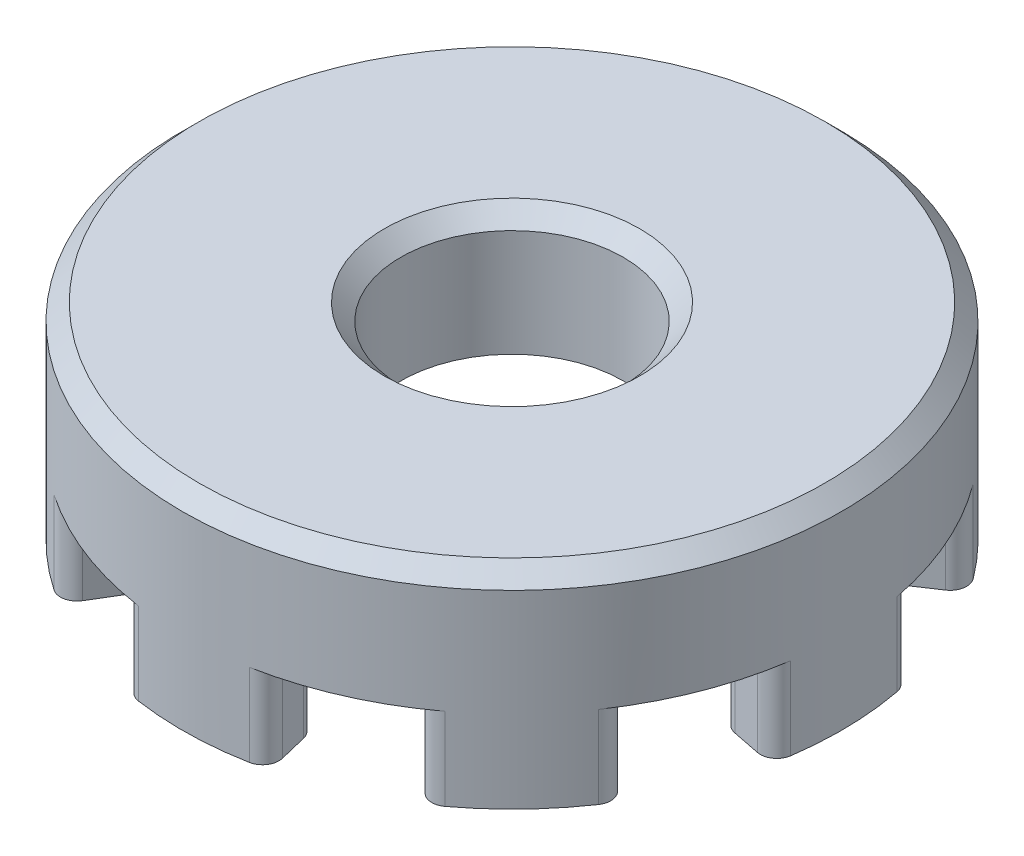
ISO-10303-21;
HEADER;
FILE_DESCRIPTION(('STEP AP214'),'2;1');
FILE_NAME('part.step','',(''),(''),'','','');
FILE_SCHEMA(('AUTOMOTIVE_DESIGN { 1 0 10303 214 1 1 1 1 }'));
ENDSEC;
DATA;
#1=APPLICATION_CONTEXT('core data for automotive mechanical design processes');
#2=APPLICATION_PROTOCOL_DEFINITION('international standard','automotive_design',2000,#1);
#3=PRODUCT_CONTEXT('',#1,'mechanical');
#4=PRODUCT('Part','Part','',(#3));
#5=PRODUCT_RELATED_PRODUCT_CATEGORY('part','',(#4));
#6=PRODUCT_DEFINITION_FORMATION('','',#4);
#7=PRODUCT_DEFINITION_CONTEXT('part definition',#1,'design');
#8=PRODUCT_DEFINITION('design','',#6,#7);
#9=PRODUCT_DEFINITION_SHAPE('','',#8);
#10=(LENGTH_UNIT() NAMED_UNIT(*) SI_UNIT(.MILLI.,.METRE.));
#11=(NAMED_UNIT(*) PLANE_ANGLE_UNIT() SI_UNIT($,.RADIAN.));
#12=(NAMED_UNIT(*) SI_UNIT($,.STERADIAN.) SOLID_ANGLE_UNIT());
#13=UNCERTAINTY_MEASURE_WITH_UNIT(LENGTH_MEASURE(1.E-05),#10,'distance_accuracy_value','');
#14=(GEOMETRIC_REPRESENTATION_CONTEXT(3) GLOBAL_UNCERTAINTY_ASSIGNED_CONTEXT((#13)) GLOBAL_UNIT_ASSIGNED_CONTEXT((#10,
#11,#12)) REPRESENTATION_CONTEXT('',''));
#15=CARTESIAN_POINT('',(0.,0.,0.));
#16=DIRECTION('',(0.,0.,1.));
#17=DIRECTION('',(1.,0.,0.));
#18=AXIS2_PLACEMENT_3D('',#15,#16,#17);
#19=CARTESIAN_POINT('',(0.,-2.,0.));
#20=DIRECTION('',(0.,1.,0.));
#21=DIRECTION('',(0.,0.,1.));
#22=AXIS2_PLACEMENT_3D('',#19,#20,#21);
#23=CYLINDRICAL_SURFACE('',#22,6.5);
#24=CARTESIAN_POINT('',(0.,0.,0.));
#25=DIRECTION('',(0.,1.,0.));
#26=DIRECTION('',(0.,0.,1.));
#27=AXIS2_PLACEMENT_3D('',#24,#25,#26);
#28=CIRCLE('',#27,6.5);
#29=CARTESIAN_POINT('',(-5.18821388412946,0.,3.91566554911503));
#30=VERTEX_POINT('',#29);
#31=CARTESIAN_POINT('',(-3.69135902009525,0.,5.35012790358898));
#32=VERTEX_POINT('',#31);
#33=EDGE_CURVE('E798',#30,#32,#28,.T.);
#34=ORIENTED_EDGE('',*,*,#33,.T.);
#35=DIRECTION('',(0.,1.,0.));
#36=VECTOR('',#35,1.);
#37=CARTESIAN_POINT('',(-3.69135902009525,-2.,5.35012790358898));
#38=LINE('',#37,#36);
#39=CARTESIAN_POINT('',(-3.69135902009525,-2.,5.35012790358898));
#40=VERTEX_POINT('',#39);
#41=EDGE_CURVE('E677',#32,#40,#38,.F.);
#42=ORIENTED_EDGE('',*,*,#41,.T.);
#43=CARTESIAN_POINT('',(0.,-2.,0.));
#44=DIRECTION('',(0.,1.,0.));
#45=DIRECTION('',(0.,0.,1.));
#46=AXIS2_PLACEMENT_3D('',#43,#44,#45);
#47=CIRCLE('',#46,6.5);
#48=CARTESIAN_POINT('',(-5.18821388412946,-2.,3.91566554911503));
#49=VERTEX_POINT('',#48);
#50=EDGE_CURVE('E934',#49,#40,#47,.T.);
#51=ORIENTED_EDGE('',*,*,#50,.F.);
#52=DIRECTION('',(0.,1.,0.));
#53=VECTOR('',#52,1.);
#54=CARTESIAN_POINT('',(-5.18821388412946,-2.,3.91566554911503));
#55=LINE('',#54,#53);
#56=EDGE_CURVE('E674',#49,#30,#55,.T.);
#57=ORIENTED_EDGE('',*,*,#56,.T.);
#58=EDGE_LOOP('',(#34,#42,#51,#57));
#59=FACE_BOUND('',#58,.T.);
#60=ADVANCED_FACE('F37',(#59),#23,.F.);
#61=CARTESIAN_POINT('',(0.,-2.,0.));
#62=DIRECTION('',(0.,1.,0.));
#63=DIRECTION('',(0.,0.,1.));
#64=AXIS2_PLACEMENT_3D('',#61,#62,#63);
#65=PLANE('',#64);
#66=CARTESIAN_POINT('',(0.,-2.,0.));
#67=DIRECTION('',(0.,1.,0.));
#68=DIRECTION('',(0.,0.,1.));
#69=AXIS2_PLACEMENT_3D('',#66,#67,#68);
#70=CIRCLE('',#69,8.);
#71=CARTESIAN_POINT('',(-6.41117429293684,-2.,4.78506470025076));
#72=VERTEX_POINT('',#71);
#73=CARTESIAN_POINT('',(-4.50793341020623,-2.,6.60897392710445));
#74=VERTEX_POINT('',#73);
#75=EDGE_CURVE('E808',#72,#74,#70,.T.);
#76=ORIENTED_EDGE('',*,*,#75,.F.);
#77=CARTESIAN_POINT('',(-6.09061557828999,-2.,4.54581146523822));
#78=DIRECTION('',(0.,1.,0.));
#79=DIRECTION('',(0.,0.,1.));
#80=AXIS2_PLACEMENT_3D('',#77,#78,#79);
#81=CIRCLE('',#80,0.4);
#82=CARTESIAN_POINT('',(-6.31266569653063,-2.,4.21310477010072));
#83=VERTEX_POINT('',#82);
#84=EDGE_CURVE('E601',#72,#83,#81,.F.);
#85=ORIENTED_EDGE('',*,*,#84,.T.);
#86=DIRECTION('',(-0.831766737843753,0.,0.555125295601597));
#87=VECTOR('',#86,1.);
#88=CARTESIAN_POINT('',(0.,-2.,0.));
#89=LINE('',#88,#87);
#90=CARTESIAN_POINT('',(-5.72953870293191,-2.,3.82392288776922));
#91=VERTEX_POINT('',#90);
#92=EDGE_CURVE('E847',#91,#83,#89,.T.);
#93=ORIENTED_EDGE('',*,*,#92,.F.);
#94=CARTESIAN_POINT('',(-5.50748858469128,-2.,4.15662958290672));
#95=DIRECTION('',(0.,1.,0.));
#96=DIRECTION('',(0.,0.,1.));
#97=AXIS2_PLACEMENT_3D('',#94,#95,#96);
#98=CIRCLE('',#97,0.4);
#99=EDGE_CURVE('E595',#91,#49,#98,.F.);
#100=ORIENTED_EDGE('',*,*,#99,.T.);
#101=ORIENTED_EDGE('',*,*,#50,.T.);
#102=CARTESIAN_POINT('',(-3.91851957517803,-2.,5.67936654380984));
#103=DIRECTION('',(0.,1.,0.));
#104=DIRECTION('',(0.,0.,1.));
#105=AXIS2_PLACEMENT_3D('',#102,#103,#104);
#106=CIRCLE('',#105,0.4);
#107=CARTESIAN_POINT('',(-3.57666589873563,-2.,5.88705877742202));
#108=VERTEX_POINT('',#107);
#109=EDGE_CURVE('E597',#40,#108,#106,.F.);
#110=ORIENTED_EDGE('',*,*,#109,.T.);
#111=DIRECTION('',(0.519230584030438,0.,-0.854634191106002));
#112=VECTOR('',#111,1.);
#113=CARTESIAN_POINT('',(0.,-2.,0.));
#114=LINE('',#113,#112);
#115=CARTESIAN_POINT('',(-3.94068306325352,-2.,6.4862174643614));
#116=VERTEX_POINT('',#115);
#117=EDGE_CURVE('E924',#116,#108,#114,.T.);
#118=ORIENTED_EDGE('',*,*,#117,.F.);
#119=CARTESIAN_POINT('',(-4.28253673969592,-2.,6.27852523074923));
#120=DIRECTION('',(0.,1.,0.));
#121=DIRECTION('',(0.,0.,1.));
#122=AXIS2_PLACEMENT_3D('',#119,#120,#121);
#123=CIRCLE('',#122,0.4);
#124=EDGE_CURVE('E599',#116,#74,#123,.F.);
#125=ORIENTED_EDGE('',*,*,#124,.T.);
#126=EDGE_LOOP('',(#76,#85,#93,#100,#101,#110,#118,#125));
#127=FACE_BOUND('',#126,.T.);
#128=ADVANCED_FACE('F846',(#127),#65,.F.);
#129=CARTESIAN_POINT('',(-6.43741488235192,0.,-0.899827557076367));
#130=VERTEX_POINT('',#129);
#131=CARTESIAN_POINT('',(-6.3932967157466,0.,1.17292672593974));
#132=VERTEX_POINT('',#131);
#133=EDGE_CURVE('E802',#130,#132,#28,.T.);
#134=ORIENTED_EDGE('',*,*,#133,.T.);
#135=DIRECTION('',(0.,1.,0.));
#136=VECTOR('',#135,1.);
#137=CARTESIAN_POINT('',(-6.3932967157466,-2.,1.17292672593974));
#138=LINE('',#137,#136);
#139=CARTESIAN_POINT('',(-6.3932967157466,-2.,1.17292672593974));
#140=VERTEX_POINT('',#139);
#141=EDGE_CURVE('E683',#132,#140,#138,.F.);
#142=ORIENTED_EDGE('',*,*,#141,.T.);
#143=CARTESIAN_POINT('',(-6.43741488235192,-2.,-0.899827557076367));
#144=VERTEX_POINT('',#143);
#145=EDGE_CURVE('E955',#144,#140,#47,.T.);
#146=ORIENTED_EDGE('',*,*,#145,.F.);
#147=DIRECTION('',(0.,1.,0.));
#148=VECTOR('',#147,1.);
#149=CARTESIAN_POINT('',(-6.43741488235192,-2.,-0.899827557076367));
#150=LINE('',#149,#148);
#151=EDGE_CURVE('E680',#144,#130,#150,.T.);
#152=ORIENTED_EDGE('',*,*,#151,.T.);
#153=EDGE_LOOP('',(#134,#142,#146,#152));
#154=FACE_BOUND('',#153,.T.);
#155=ADVANCED_FACE('F981',(#154),#23,.F.);
#156=CARTESIAN_POINT('',(-7.91693651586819,-2.,-1.14983311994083));
#157=VERTEX_POINT('',#156);
#158=CARTESIAN_POINT('',(-7.86084056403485,-2.,1.48565999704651));
#159=VERTEX_POINT('',#158);
#160=EDGE_CURVE('E1007',#157,#159,#70,.T.);
#161=ORIENTED_EDGE('',*,*,#160,.F.);
#162=CARTESIAN_POINT('',(-7.52108969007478,-2.,-1.09234146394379));
#163=DIRECTION('',(0.,1.,0.));
#164=DIRECTION('',(0.,0.,1.));
#165=AXIS2_PLACEMENT_3D('',#162,#163,#164);
#166=CIRCLE('',#165,0.4);
#167=CARTESIAN_POINT('',(-7.44284367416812,-2.,-1.48461376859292));
#168=VERTEX_POINT('',#167);
#169=EDGE_CURVE('E584',#157,#168,#166,.F.);
#170=ORIENTED_EDGE('',*,*,#169,.T.);
#171=DIRECTION('',(-0.980680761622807,0.,-0.195615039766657));
#172=VECTOR('',#171,1.);
#173=CARTESIAN_POINT('',(0.,-2.,0.));
#174=LINE('',#173,#172);
#175=CARTESIAN_POINT('',(-6.75531747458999,-2.,-1.34747386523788));
#176=VERTEX_POINT('',#175);
#177=EDGE_CURVE('E868',#176,#168,#174,.T.);
#178=ORIENTED_EDGE('',*,*,#177,.F.);
#179=CARTESIAN_POINT('',(-6.83356349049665,-2.,-0.955201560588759));
#180=DIRECTION('',(0.,1.,0.));
#181=DIRECTION('',(0.,0.,1.));
#182=AXIS2_PLACEMENT_3D('',#179,#180,#181);
#183=CIRCLE('',#182,0.4);
#184=EDGE_CURVE('E578',#176,#144,#183,.F.);
#185=ORIENTED_EDGE('',*,*,#184,.T.);
#186=ORIENTED_EDGE('',*,*,#145,.T.);
#187=CARTESIAN_POINT('',(-6.78673035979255,-2.,1.24510683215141));
#188=DIRECTION('',(0.,1.,0.));
#189=DIRECTION('',(0.,0.,1.));
#190=AXIS2_PLACEMENT_3D('',#187,#188,#189);
#191=CIRCLE('',#190,0.4);
#192=CARTESIAN_POINT('',(-6.69186389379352,-2.,1.63369447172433));
#193=VERTEX_POINT('',#192);
#194=EDGE_CURVE('E580',#140,#193,#191,.F.);
#195=ORIENTED_EDGE('',*,*,#194,.T.);
#196=DIRECTION('',(0.971469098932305,0.,-0.237166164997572));
#197=VECTOR('',#196,1.);
#198=CARTESIAN_POINT('',(0.,-2.,0.));
#199=LINE('',#198,#197);
#200=CARTESIAN_POINT('',(-7.37293206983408,-2.,1.79996463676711));
#201=VERTEX_POINT('',#200);
#202=EDGE_CURVE('E852',#201,#193,#199,.T.);
#203=ORIENTED_EDGE('',*,*,#202,.F.);
#204=CARTESIAN_POINT('',(-7.46779853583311,-2.,1.41137699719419));
#205=DIRECTION('',(0.,1.,0.));
#206=DIRECTION('',(0.,0.,1.));
#207=AXIS2_PLACEMENT_3D('',#204,#205,#206);
#208=CIRCLE('',#207,0.4);
#209=EDGE_CURVE('E582',#201,#159,#208,.F.);
#210=ORIENTED_EDGE('',*,*,#209,.T.);
#211=EDGE_LOOP('',(#161,#170,#178,#185,#186,#195,#203,#210));
#212=FACE_BOUND('',#211,.T.);
#213=ADVANCED_FACE('F1106',(#212),#65,.F.);
#214=CARTESIAN_POINT('',(-3.91566554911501,0.,-5.18821388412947));
#215=VERTEX_POINT('',#214);
#216=CARTESIAN_POINT('',(-5.35012790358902,0.,-3.69135902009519));
#217=VERTEX_POINT('',#216);
#218=EDGE_CURVE('E814',#215,#217,#28,.T.);
#219=ORIENTED_EDGE('',*,*,#218,.T.);
#220=DIRECTION('',(0.,1.,0.));
#221=VECTOR('',#220,1.);
#222=CARTESIAN_POINT('',(-5.35012790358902,-2.,-3.69135902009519));
#223=LINE('',#222,#221);
#224=CARTESIAN_POINT('',(-5.35012790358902,-2.,-3.69135902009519));
#225=VERTEX_POINT('',#224);
#226=EDGE_CURVE('E689',#217,#225,#223,.F.);
#227=ORIENTED_EDGE('',*,*,#226,.T.);
#228=CARTESIAN_POINT('',(-3.91566554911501,-2.,-5.18821388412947));
#229=VERTEX_POINT('',#228);
#230=EDGE_CURVE('E951',#229,#225,#47,.T.);
#231=ORIENTED_EDGE('',*,*,#230,.F.);
#232=DIRECTION('',(0.,1.,0.));
#233=VECTOR('',#232,1.);
#234=CARTESIAN_POINT('',(-3.91566554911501,-2.,-5.18821388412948));
#235=LINE('',#234,#233);
#236=EDGE_CURVE('E686',#229,#215,#235,.T.);
#237=ORIENTED_EDGE('',*,*,#236,.T.);
#238=EDGE_LOOP('',(#219,#227,#231,#237));
#239=FACE_BOUND('',#238,.T.);
#240=ADVANCED_FACE('F987',(#239),#23,.F.);
#241=CARTESIAN_POINT('',(-4.78506470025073,-2.,-6.41117429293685));
#242=VERTEX_POINT('',#241);
#243=CARTESIAN_POINT('',(-6.6089739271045,-2.,-4.50793341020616));
#244=VERTEX_POINT('',#243);
#245=EDGE_CURVE('E809',#242,#244,#70,.T.);
#246=ORIENTED_EDGE('',*,*,#245,.F.);
#247=CARTESIAN_POINT('',(-4.5458114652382,-2.,-6.09061557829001));
#248=DIRECTION('',(0.,1.,0.));
#249=DIRECTION('',(0.,0.,1.));
#250=AXIS2_PLACEMENT_3D('',#247,#248,#249);
#251=CIRCLE('',#250,0.4);
#252=CARTESIAN_POINT('',(-4.2131047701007,-2.,-6.31266569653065));
#253=VERTEX_POINT('',#252);
#254=EDGE_CURVE('E567',#242,#253,#251,.F.);
#255=ORIENTED_EDGE('',*,*,#254,.T.);
#256=DIRECTION('',(-0.555125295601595,0.,-0.831766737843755));
#257=VECTOR('',#256,1.);
#258=CARTESIAN_POINT('',(0.,-2.,0.));
#259=LINE('',#258,#257);
#260=CARTESIAN_POINT('',(-3.8239228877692,-2.,-5.72953870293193));
#261=VERTEX_POINT('',#260);
#262=EDGE_CURVE('E867',#261,#253,#259,.T.);
#263=ORIENTED_EDGE('',*,*,#262,.F.);
#264=CARTESIAN_POINT('',(-4.1566295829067,-2.,-5.50748858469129));
#265=DIRECTION('',(0.,1.,0.));
#266=DIRECTION('',(0.,0.,1.));
#267=AXIS2_PLACEMENT_3D('',#264,#265,#266);
#268=CIRCLE('',#267,0.4);
#269=EDGE_CURVE('E561',#261,#229,#268,.F.);
#270=ORIENTED_EDGE('',*,*,#269,.T.);
#271=ORIENTED_EDGE('',*,*,#230,.T.);
#272=CARTESIAN_POINT('',(-5.67936654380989,-2.,-3.91851957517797));
#273=DIRECTION('',(0.,1.,0.));
#274=DIRECTION('',(0.,0.,1.));
#275=AXIS2_PLACEMENT_3D('',#272,#273,#274);
#276=CIRCLE('',#275,0.4);
#277=CARTESIAN_POINT('',(-5.88705877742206,-2.,-3.57666589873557));
#278=VERTEX_POINT('',#277);
#279=EDGE_CURVE('E563',#225,#278,#276,.F.);
#280=ORIENTED_EDGE('',*,*,#279,.T.);
#281=DIRECTION('',(0.854634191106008,0.,0.519230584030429));
#282=VECTOR('',#281,1.);
#283=CARTESIAN_POINT('',(0.,-2.,0.));
#284=LINE('',#283,#282);
#285=CARTESIAN_POINT('',(-6.48621746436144,-2.,-3.94068306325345));
#286=VERTEX_POINT('',#285);
#287=EDGE_CURVE('E864',#286,#278,#284,.T.);
#288=ORIENTED_EDGE('',*,*,#287,.F.);
#289=CARTESIAN_POINT('',(-6.27852523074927,-2.,-4.28253673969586));
#290=DIRECTION('',(0.,1.,0.));
#291=DIRECTION('',(0.,0.,1.));
#292=AXIS2_PLACEMENT_3D('',#289,#290,#291);
#293=CIRCLE('',#292,0.4);
#294=EDGE_CURVE('E565',#286,#244,#293,.F.);
#295=ORIENTED_EDGE('',*,*,#294,.T.);
#296=EDGE_LOOP('',(#246,#255,#263,#270,#271,#280,#288,#295));
#297=FACE_BOUND('',#296,.T.);
#298=ADVANCED_FACE('F995',(#297),#65,.F.);
#299=CARTESIAN_POINT('',(0.899827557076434,-2.,-6.43741488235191));
#300=VERTEX_POINT('',#299);
#301=CARTESIAN_POINT('',(-1.17292672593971,-2.,-6.39329671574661));
#302=VERTEX_POINT('',#301);
#303=EDGE_CURVE('E947',#300,#302,#47,.T.);
#304=ORIENTED_EDGE('',*,*,#303,.F.);
#305=DIRECTION('',(0.,1.,0.));
#306=VECTOR('',#305,1.);
#307=CARTESIAN_POINT('',(0.899827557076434,-2.,-6.43741488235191));
#308=LINE('',#307,#306);
#309=CARTESIAN_POINT('',(0.899827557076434,0.,-6.43741488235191));
#310=VERTEX_POINT('',#309);
#311=EDGE_CURVE('E453',#300,#310,#308,.T.);
#312=ORIENTED_EDGE('',*,*,#311,.T.);
#313=CARTESIAN_POINT('',(-1.17292672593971,0.,-6.39329671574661));
#314=VERTEX_POINT('',#313);
#315=EDGE_CURVE('E811',#310,#314,#28,.T.);
#316=ORIENTED_EDGE('',*,*,#315,.T.);
#317=DIRECTION('',(0.,1.,0.));
#318=VECTOR('',#317,1.);
#319=CARTESIAN_POINT('',(-1.17292672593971,-2.,-6.39329671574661));
#320=LINE('',#319,#318);
#321=EDGE_CURVE('E692',#314,#302,#320,.F.);
#322=ORIENTED_EDGE('',*,*,#321,.T.);
#323=EDGE_LOOP('',(#304,#312,#316,#322));
#324=FACE_BOUND('',#323,.T.);
#325=ADVANCED_FACE('F1128',(#324),#23,.F.);
#326=CARTESIAN_POINT('',(1.14983311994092,-2.,-7.91693651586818));
#327=VERTEX_POINT('',#326);
#328=CARTESIAN_POINT('',(-1.48565999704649,-2.,-7.86084056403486));
#329=VERTEX_POINT('',#328);
#330=EDGE_CURVE('E1006',#327,#329,#70,.T.);
#331=ORIENTED_EDGE('',*,*,#330,.F.);
#332=CARTESIAN_POINT('',(1.09234146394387,-2.,-7.52108969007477));
#333=DIRECTION('',(0.,1.,0.));
#334=DIRECTION('',(0.,0.,1.));
#335=AXIS2_PLACEMENT_3D('',#332,#333,#334);
#336=CIRCLE('',#335,0.4);
#337=CARTESIAN_POINT('',(1.48461376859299,-2.,-7.4428436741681));
#338=VERTEX_POINT('',#337);
#339=EDGE_CURVE('E550',#327,#338,#336,.F.);
#340=ORIENTED_EDGE('',*,*,#339,.T.);
#341=DIRECTION('',(0.195615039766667,0.,-0.980680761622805));
#342=VECTOR('',#341,1.);
#343=CARTESIAN_POINT('',(0.,-2.,0.));
#344=LINE('',#343,#342);
#345=CARTESIAN_POINT('',(1.34747386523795,-2.,-6.75531747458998));
#346=VERTEX_POINT('',#345);
#347=EDGE_CURVE('E879',#346,#338,#344,.T.);
#348=ORIENTED_EDGE('',*,*,#347,.F.);
#349=CARTESIAN_POINT('',(0.95520156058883,-2.,-6.83356349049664));
#350=DIRECTION('',(0.,1.,0.));
#351=DIRECTION('',(0.,0.,1.));
#352=AXIS2_PLACEMENT_3D('',#349,#350,#351);
#353=CIRCLE('',#352,0.4);
#354=EDGE_CURVE('E546',#346,#300,#353,.F.);
#355=ORIENTED_EDGE('',*,*,#354,.T.);
#356=ORIENTED_EDGE('',*,*,#303,.T.);
#357=CARTESIAN_POINT('',(-1.24510683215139,-2.,-6.78673035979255));
#358=DIRECTION('',(0.,1.,0.));
#359=DIRECTION('',(0.,0.,1.));
#360=AXIS2_PLACEMENT_3D('',#357,#358,#359);
#361=CIRCLE('',#360,0.4);
#362=CARTESIAN_POINT('',(-1.63369447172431,-2.,-6.69186389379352));
#363=VERTEX_POINT('',#362);
#364=EDGE_CURVE('E544',#302,#363,#361,.F.);
#365=ORIENTED_EDGE('',*,*,#364,.T.);
#366=DIRECTION('',(0.237166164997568,0.,0.971469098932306));
#367=VECTOR('',#366,1.);
#368=CARTESIAN_POINT('',(0.,-2.,0.));
#369=LINE('',#368,#367);
#370=CARTESIAN_POINT('',(-1.79996463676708,-2.,-7.37293206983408));
#371=VERTEX_POINT('',#370);
#372=EDGE_CURVE('E877',#371,#363,#369,.T.);
#373=ORIENTED_EDGE('',*,*,#372,.F.);
#374=CARTESIAN_POINT('',(-1.41137699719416,-2.,-7.46779853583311));
#375=DIRECTION('',(0.,1.,0.));
#376=DIRECTION('',(0.,0.,1.));
#377=AXIS2_PLACEMENT_3D('',#374,#375,#376);
#378=CIRCLE('',#377,0.4);
#379=EDGE_CURVE('E548',#371,#329,#378,.F.);
#380=ORIENTED_EDGE('',*,*,#379,.T.);
#381=EDGE_LOOP('',(#331,#340,#348,#355,#356,#365,#373,#380));
#382=FACE_BOUND('',#381,.T.);
#383=ADVANCED_FACE('F1126',(#382),#65,.F.);
#384=CARTESIAN_POINT('',(5.18821388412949,0.,-3.91566554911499));
#385=VERTEX_POINT('',#384);
#386=CARTESIAN_POINT('',(3.69135902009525,0.,-5.35012790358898));
#387=VERTEX_POINT('',#386);
#388=EDGE_CURVE('E813',#385,#387,#28,.T.);
#389=ORIENTED_EDGE('',*,*,#388,.T.);
#390=DIRECTION('',(0.,1.,0.));
#391=VECTOR('',#390,1.);
#392=CARTESIAN_POINT('',(3.69135902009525,-2.,-5.35012790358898));
#393=LINE('',#392,#391);
#394=CARTESIAN_POINT('',(3.69135902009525,-2.,-5.35012790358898));
#395=VERTEX_POINT('',#394);
#396=EDGE_CURVE('E653',#387,#395,#393,.F.);
#397=ORIENTED_EDGE('',*,*,#396,.T.);
#398=CARTESIAN_POINT('',(5.18821388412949,-2.,-3.91566554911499));
#399=VERTEX_POINT('',#398);
#400=EDGE_CURVE('E943',#399,#395,#47,.T.);
#401=ORIENTED_EDGE('',*,*,#400,.F.);
#402=DIRECTION('',(0.,1.,0.));
#403=VECTOR('',#402,1.);
#404=CARTESIAN_POINT('',(5.18821388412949,-2.,-3.91566554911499));
#405=LINE('',#404,#403);
#406=EDGE_CURVE('E650',#399,#385,#405,.T.);
#407=ORIENTED_EDGE('',*,*,#406,.T.);
#408=EDGE_LOOP('',(#389,#397,#401,#407));
#409=FACE_BOUND('',#408,.T.);
#410=ADVANCED_FACE('F1033',(#409),#23,.F.);
#411=CARTESIAN_POINT('',(6.41117429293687,-2.,-4.78506470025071));
#412=VERTEX_POINT('',#411);
#413=CARTESIAN_POINT('',(4.50793341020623,-2.,-6.60897392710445));
#414=VERTEX_POINT('',#413);
#415=EDGE_CURVE('E1010',#412,#414,#70,.T.);
#416=ORIENTED_EDGE('',*,*,#415,.F.);
#417=CARTESIAN_POINT('',(6.09061557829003,-2.,-4.54581146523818));
#418=DIRECTION('',(0.,1.,0.));
#419=DIRECTION('',(0.,0.,1.));
#420=AXIS2_PLACEMENT_3D('',#417,#418,#419);
#421=CIRCLE('',#420,0.4);
#422=CARTESIAN_POINT('',(6.31266569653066,-2.,-4.21310477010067));
#423=VERTEX_POINT('',#422);
#424=EDGE_CURVE('E533',#412,#423,#421,.F.);
#425=ORIENTED_EDGE('',*,*,#424,.T.);
#426=DIRECTION('',(0.831766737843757,0.,-0.555125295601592));
#427=VECTOR('',#426,1.);
#428=CARTESIAN_POINT('',(0.,-2.,0.));
#429=LINE('',#428,#427);
#430=CARTESIAN_POINT('',(5.72953870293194,-2.,-3.82392288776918));
#431=VERTEX_POINT('',#430);
#432=EDGE_CURVE('E891',#431,#423,#429,.T.);
#433=ORIENTED_EDGE('',*,*,#432,.F.);
#434=CARTESIAN_POINT('',(5.5074885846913,-2.,-4.15662958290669));
#435=DIRECTION('',(0.,1.,0.));
#436=DIRECTION('',(0.,0.,1.));
#437=AXIS2_PLACEMENT_3D('',#434,#435,#436);
#438=CIRCLE('',#437,0.4);
#439=EDGE_CURVE('E527',#431,#399,#438,.F.);
#440=ORIENTED_EDGE('',*,*,#439,.T.);
#441=ORIENTED_EDGE('',*,*,#400,.T.);
#442=CARTESIAN_POINT('',(3.91851957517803,-2.,-5.67936654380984));
#443=DIRECTION('',(0.,1.,0.));
#444=DIRECTION('',(0.,0.,1.));
#445=AXIS2_PLACEMENT_3D('',#442,#443,#444);
#446=CIRCLE('',#445,0.4);
#447=CARTESIAN_POINT('',(3.57666589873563,-2.,-5.88705877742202));
#448=VERTEX_POINT('',#447);
#449=EDGE_CURVE('E529',#395,#448,#446,.F.);
#450=ORIENTED_EDGE('',*,*,#449,.T.);
#451=DIRECTION('',(-0.519230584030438,0.,0.854634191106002));
#452=VECTOR('',#451,1.);
#453=CARTESIAN_POINT('',(0.,-2.,0.));
#454=LINE('',#453,#452);
#455=CARTESIAN_POINT('',(3.94068306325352,-2.,-6.4862174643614));
#456=VERTEX_POINT('',#455);
#457=EDGE_CURVE('E888',#456,#448,#454,.T.);
#458=ORIENTED_EDGE('',*,*,#457,.F.);
#459=CARTESIAN_POINT('',(4.28253673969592,-2.,-6.27852523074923));
#460=DIRECTION('',(0.,1.,0.));
#461=DIRECTION('',(0.,0.,1.));
#462=AXIS2_PLACEMENT_3D('',#459,#460,#461);
#463=CIRCLE('',#462,0.4);
#464=EDGE_CURVE('E531',#456,#414,#463,.F.);
#465=ORIENTED_EDGE('',*,*,#464,.T.);
#466=EDGE_LOOP('',(#416,#425,#433,#440,#441,#450,#458,#465));
#467=FACE_BOUND('',#466,.T.);
#468=ADVANCED_FACE('F1121',(#467),#65,.F.);
#469=CARTESIAN_POINT('',(6.43741488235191,0.,0.899827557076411));
#470=VERTEX_POINT('',#469);
#471=CARTESIAN_POINT('',(6.39329671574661,0.,-1.17292672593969));
#472=VERTEX_POINT('',#471);
#473=EDGE_CURVE('E1035',#470,#472,#28,.T.);
#474=ORIENTED_EDGE('',*,*,#473,.T.);
#475=DIRECTION('',(0.,1.,0.));
#476=VECTOR('',#475,1.);
#477=CARTESIAN_POINT('',(6.39329671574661,-2.,-1.17292672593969));
#478=LINE('',#477,#476);
#479=CARTESIAN_POINT('',(6.39329671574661,-2.,-1.17292672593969));
#480=VERTEX_POINT('',#479);
#481=EDGE_CURVE('E659',#472,#480,#478,.F.);
#482=ORIENTED_EDGE('',*,*,#481,.T.);
#483=CARTESIAN_POINT('',(6.43741488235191,-2.,0.899827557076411));
#484=VERTEX_POINT('',#483);
#485=EDGE_CURVE('E938',#484,#480,#47,.T.);
#486=ORIENTED_EDGE('',*,*,#485,.F.);
#487=DIRECTION('',(0.,1.,0.));
#488=VECTOR('',#487,1.);
#489=CARTESIAN_POINT('',(6.43741488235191,-2.,0.899827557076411));
#490=LINE('',#489,#488);
#491=EDGE_CURVE('E656',#484,#470,#490,.T.);
#492=ORIENTED_EDGE('',*,*,#491,.T.);
#493=EDGE_LOOP('',(#474,#482,#486,#492));
#494=FACE_BOUND('',#493,.T.);
#495=ADVANCED_FACE('F1116',(#494),#23,.F.);
#496=DIRECTION('',(-0.971469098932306,0.,0.237166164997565));
#497=VECTOR('',#496,1.);
#498=CARTESIAN_POINT('',(0.,-2.,0.));
#499=LINE('',#498,#497);
#500=CARTESIAN_POINT('',(7.37293206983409,-2.,-1.79996463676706));
#501=VERTEX_POINT('',#500);
#502=CARTESIAN_POINT('',(6.69186389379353,-2.,-1.63369447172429));
#503=VERTEX_POINT('',#502);
#504=EDGE_CURVE('E897',#501,#503,#499,.T.);
#505=ORIENTED_EDGE('',*,*,#504,.F.);
#506=CARTESIAN_POINT('',(7.46779853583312,-2.,-1.41137699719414));
#507=DIRECTION('',(0.,1.,0.));
#508=DIRECTION('',(0.,0.,1.));
#509=AXIS2_PLACEMENT_3D('',#506,#507,#508);
#510=CIRCLE('',#509,0.4);
#511=CARTESIAN_POINT('',(7.86084056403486,-2.,-1.48565999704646));
#512=VERTEX_POINT('',#511);
#513=EDGE_CURVE('E467',#501,#512,#510,.F.);
#514=ORIENTED_EDGE('',*,*,#513,.T.);
#515=CARTESIAN_POINT('',(7.91693651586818,-2.,1.14983311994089));
#516=VERTEX_POINT('',#515);
#517=EDGE_CURVE('E1008',#516,#512,#70,.T.);
#518=ORIENTED_EDGE('',*,*,#517,.F.);
#519=CARTESIAN_POINT('',(7.52108969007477,-2.,1.09234146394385));
#520=DIRECTION('',(0.,1.,0.));
#521=DIRECTION('',(0.,0.,1.));
#522=AXIS2_PLACEMENT_3D('',#519,#520,#521);
#523=CIRCLE('',#522,0.4);
#524=CARTESIAN_POINT('',(7.44284367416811,-2.,1.48461376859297));
#525=VERTEX_POINT('',#524);
#526=EDGE_CURVE('E477',#516,#525,#523,.F.);
#527=ORIENTED_EDGE('',*,*,#526,.T.);
#528=DIRECTION('',(0.980680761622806,0.,0.195615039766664));
#529=VECTOR('',#528,1.);
#530=CARTESIAN_POINT('',(0.,-2.,0.));
#531=LINE('',#530,#529);
#532=CARTESIAN_POINT('',(6.75531747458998,-2.,1.34747386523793));
#533=VERTEX_POINT('',#532);
#534=EDGE_CURVE('E463',#533,#525,#531,.T.);
#535=ORIENTED_EDGE('',*,*,#534,.F.);
#536=CARTESIAN_POINT('',(6.83356349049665,-2.,0.955201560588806));
#537=DIRECTION('',(0.,1.,0.));
#538=DIRECTION('',(0.,0.,1.));
#539=AXIS2_PLACEMENT_3D('',#536,#537,#538);
#540=CIRCLE('',#539,0.4);
#541=EDGE_CURVE('E468',#533,#484,#540,.F.);
#542=ORIENTED_EDGE('',*,*,#541,.T.);
#543=ORIENTED_EDGE('',*,*,#485,.T.);
#544=CARTESIAN_POINT('',(6.78673035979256,-2.,-1.24510683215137));
#545=DIRECTION('',(0.,1.,0.));
#546=DIRECTION('',(0.,0.,1.));
#547=AXIS2_PLACEMENT_3D('',#544,#545,#546);
#548=CIRCLE('',#547,0.4);
#549=EDGE_CURVE('E470',#480,#503,#548,.F.);
#550=ORIENTED_EDGE('',*,*,#549,.T.);
#551=EDGE_LOOP('',(#505,#514,#518,#527,#535,#542,#543,#550));
#552=FACE_BOUND('',#551,.T.);
#553=ADVANCED_FACE('F1115',(#552),#65,.F.);
#554=CARTESIAN_POINT('',(3.91566554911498,0.,5.1882138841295));
#555=VERTEX_POINT('',#554);
#556=CARTESIAN_POINT('',(5.350127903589,0.,3.69135902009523));
#557=VERTEX_POINT('',#556);
#558=EDGE_CURVE('E1037',#555,#557,#28,.T.);
#559=ORIENTED_EDGE('',*,*,#558,.T.);
#560=DIRECTION('',(0.,1.,0.));
#561=VECTOR('',#560,1.);
#562=CARTESIAN_POINT('',(5.350127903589,-2.,3.69135902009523));
#563=LINE('',#562,#561);
#564=CARTESIAN_POINT('',(5.350127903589,-2.,3.69135902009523));
#565=VERTEX_POINT('',#564);
#566=EDGE_CURVE('E665',#557,#565,#563,.F.);
#567=ORIENTED_EDGE('',*,*,#566,.T.);
#568=CARTESIAN_POINT('',(3.91566554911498,-2.,5.1882138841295));
#569=VERTEX_POINT('',#568);
#570=EDGE_CURVE('E935',#569,#565,#47,.T.);
#571=ORIENTED_EDGE('',*,*,#570,.F.);
#572=DIRECTION('',(0.,1.,0.));
#573=VECTOR('',#572,1.);
#574=CARTESIAN_POINT('',(3.91566554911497,-2.,5.1882138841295));
#575=LINE('',#574,#573);
#576=EDGE_CURVE('E662',#569,#555,#575,.T.);
#577=ORIENTED_EDGE('',*,*,#576,.T.);
#578=EDGE_LOOP('',(#559,#567,#571,#577));
#579=FACE_BOUND('',#578,.T.);
#580=ADVANCED_FACE('F1109',(#579),#23,.F.);
#581=CARTESIAN_POINT('',(4.78506470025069,-2.,6.41117429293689));
#582=VERTEX_POINT('',#581);
#583=CARTESIAN_POINT('',(6.60897392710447,-2.,4.50793341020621));
#584=VERTEX_POINT('',#583);
#585=EDGE_CURVE('E806',#582,#584,#70,.T.);
#586=ORIENTED_EDGE('',*,*,#585,.F.);
#587=CARTESIAN_POINT('',(4.54581146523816,-2.,6.09061557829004));
#588=DIRECTION('',(0.,1.,0.));
#589=DIRECTION('',(0.,0.,1.));
#590=AXIS2_PLACEMENT_3D('',#587,#588,#589);
#591=CIRCLE('',#590,0.4);
#592=CARTESIAN_POINT('',(4.21310477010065,-2.,6.31266569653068));
#593=VERTEX_POINT('',#592);
#594=EDGE_CURVE('E635',#582,#593,#591,.F.);
#595=ORIENTED_EDGE('',*,*,#594,.T.);
#596=DIRECTION('',(-0.555125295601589,0.,-0.831766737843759));
#597=VECTOR('',#596,1.);
#598=CARTESIAN_POINT('',(0.,-2.,0.));
#599=LINE('',#598,#597);
#600=CARTESIAN_POINT('',(3.82392288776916,-2.,5.72953870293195));
#601=VERTEX_POINT('',#600);
#602=EDGE_CURVE('E818',#593,#601,#599,.T.);
#603=ORIENTED_EDGE('',*,*,#602,.T.);
#604=CARTESIAN_POINT('',(4.15662958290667,-2.,5.50748858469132));
#605=DIRECTION('',(0.,1.,0.));
#606=DIRECTION('',(0.,0.,1.));
#607=AXIS2_PLACEMENT_3D('',#604,#605,#606);
#608=CIRCLE('',#607,0.4);
#609=EDGE_CURVE('E629',#601,#569,#608,.F.);
#610=ORIENTED_EDGE('',*,*,#609,.T.);
#611=ORIENTED_EDGE('',*,*,#570,.T.);
#612=CARTESIAN_POINT('',(5.67936654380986,-2.,3.91851957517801));
#613=DIRECTION('',(0.,1.,0.));
#614=DIRECTION('',(0.,0.,1.));
#615=AXIS2_PLACEMENT_3D('',#612,#613,#614);
#616=CIRCLE('',#615,0.4);
#617=CARTESIAN_POINT('',(5.88705877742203,-2.,3.57666589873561));
#618=VERTEX_POINT('',#617);
#619=EDGE_CURVE('E631',#565,#618,#616,.F.);
#620=ORIENTED_EDGE('',*,*,#619,.T.);
#621=DIRECTION('',(-0.854634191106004,0.,-0.519230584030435));
#622=VECTOR('',#621,1.);
#623=CARTESIAN_POINT('',(0.,-2.,0.));
#624=LINE('',#623,#622);
#625=CARTESIAN_POINT('',(6.48621746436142,-2.,3.9406830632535));
#626=VERTEX_POINT('',#625);
#627=EDGE_CURVE('E906',#626,#618,#624,.T.);
#628=ORIENTED_EDGE('',*,*,#627,.F.);
#629=CARTESIAN_POINT('',(6.27852523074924,-2.,4.2825367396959));
#630=DIRECTION('',(0.,1.,0.));
#631=DIRECTION('',(0.,0.,1.));
#632=AXIS2_PLACEMENT_3D('',#629,#630,#631);
#633=CIRCLE('',#632,0.4);
#634=EDGE_CURVE('E633',#626,#584,#633,.F.);
#635=ORIENTED_EDGE('',*,*,#634,.T.);
#636=EDGE_LOOP('',(#586,#595,#603,#610,#611,#620,#628,#635));
#637=FACE_BOUND('',#636,.T.);
#638=ADVANCED_FACE('F1113',(#637),#65,.F.);
#639=CARTESIAN_POINT('',(0.,0.,0.));
#640=DIRECTION('',(0.,1.,0.));
#641=DIRECTION('',(0.,0.,1.));
#642=AXIS2_PLACEMENT_3D('',#639,#640,#641);
#643=PLANE('',#642);
#644=CARTESIAN_POINT('',(0.,0.,0.));
#645=DIRECTION('',(0.,1.,0.));
#646=DIRECTION('',(0.,0.,1.));
#647=AXIS2_PLACEMENT_3D('',#644,#645,#646);
#648=CIRCLE('',#647,2.7);
#649=CARTESIAN_POINT('',(0.,0.,2.7));
#650=VERTEX_POINT('',#649);
#651=EDGE_CURVE('E796',#650,#650,#648,.T.);
#652=ORIENTED_EDGE('',*,*,#651,.T.);
#653=EDGE_LOOP('',(#652));
#654=FACE_BOUND('',#653,.T.);
#655=ORIENTED_EDGE('',*,*,#33,.F.);
#656=CARTESIAN_POINT('',(-5.50748858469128,0.,4.15662958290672));
#657=DIRECTION('',(0.,1.,0.));
#658=DIRECTION('',(0.,0.,1.));
#659=AXIS2_PLACEMENT_3D('',#656,#657,#658);
#660=CIRCLE('',#659,0.4);
#661=CARTESIAN_POINT('',(-5.72953870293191,0.,3.82392288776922));
#662=VERTEX_POINT('',#661);
#663=EDGE_CURVE('E750',#30,#662,#660,.T.);
#664=ORIENTED_EDGE('',*,*,#663,.T.);
#665=DIRECTION('',(-0.831766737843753,0.,0.555125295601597));
#666=VECTOR('',#665,1.);
#667=CARTESIAN_POINT('',(0.,0.,0.));
#668=LINE('',#667,#666);
#669=CARTESIAN_POINT('',(-6.31266569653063,0.,4.21310477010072));
#670=VERTEX_POINT('',#669);
#671=EDGE_CURVE('E839',#662,#670,#668,.T.);
#672=ORIENTED_EDGE('',*,*,#671,.T.);
#673=CARTESIAN_POINT('',(-6.09061557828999,0.,4.54581146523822));
#674=DIRECTION('',(0.,1.,0.));
#675=DIRECTION('',(0.,0.,1.));
#676=AXIS2_PLACEMENT_3D('',#673,#674,#675);
#677=CIRCLE('',#676,0.4);
#678=CARTESIAN_POINT('',(-6.41117429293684,0.,4.78506470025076));
#679=VERTEX_POINT('',#678);
#680=EDGE_CURVE('E714',#670,#679,#677,.T.);
#681=ORIENTED_EDGE('',*,*,#680,.T.);
#682=CARTESIAN_POINT('',(0.,0.,0.));
#683=DIRECTION('',(0.,1.,0.));
#684=DIRECTION('',(0.,0.,1.));
#685=AXIS2_PLACEMENT_3D('',#682,#683,#684);
#686=CIRCLE('',#685,8.);
#687=CARTESIAN_POINT('',(-7.86084056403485,0.,1.48565999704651));
#688=VERTEX_POINT('',#687);
#689=EDGE_CURVE('E472',#688,#679,#686,.T.);
#690=ORIENTED_EDGE('',*,*,#689,.F.);
#691=CARTESIAN_POINT('',(-7.46779853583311,0.,1.41137699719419));
#692=DIRECTION('',(0.,1.,0.));
#693=DIRECTION('',(0.,0.,1.));
#694=AXIS2_PLACEMENT_3D('',#691,#692,#693);
#695=CIRCLE('',#694,0.4);
#696=CARTESIAN_POINT('',(-7.37293206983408,0.,1.79996463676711));
#697=VERTEX_POINT('',#696);
#698=EDGE_CURVE('E712',#688,#697,#695,.T.);
#699=ORIENTED_EDGE('',*,*,#698,.T.);
#700=DIRECTION('',(0.971469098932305,0.,-0.237166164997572));
#701=VECTOR('',#700,1.);
#702=CARTESIAN_POINT('',(0.,0.,0.));
#703=LINE('',#702,#701);
#704=CARTESIAN_POINT('',(-6.69186389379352,0.,1.63369447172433));
#705=VERTEX_POINT('',#704);
#706=EDGE_CURVE('E857',#697,#705,#703,.T.);
#707=ORIENTED_EDGE('',*,*,#706,.T.);
#708=CARTESIAN_POINT('',(-6.78673035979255,0.,1.24510683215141));
#709=DIRECTION('',(0.,1.,0.));
#710=DIRECTION('',(0.,0.,1.));
#711=AXIS2_PLACEMENT_3D('',#708,#709,#710);
#712=CIRCLE('',#711,0.4);
#713=EDGE_CURVE('E752',#705,#132,#712,.T.);
#714=ORIENTED_EDGE('',*,*,#713,.T.);
#715=ORIENTED_EDGE('',*,*,#133,.F.);
#716=CARTESIAN_POINT('',(-6.83356349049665,0.,-0.955201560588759));
#717=DIRECTION('',(0.,1.,0.));
#718=DIRECTION('',(0.,0.,1.));
#719=AXIS2_PLACEMENT_3D('',#716,#717,#718);
#720=CIRCLE('',#719,0.4);
#721=CARTESIAN_POINT('',(-6.75531747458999,0.,-1.34747386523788));
#722=VERTEX_POINT('',#721);
#723=EDGE_CURVE('E754',#130,#722,#720,.T.);
#724=ORIENTED_EDGE('',*,*,#723,.T.);
#725=DIRECTION('',(-0.980680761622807,0.,-0.195615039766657));
#726=VECTOR('',#725,1.);
#727=CARTESIAN_POINT('',(0.,0.,0.));
#728=LINE('',#727,#726);
#729=CARTESIAN_POINT('',(-7.44284367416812,0.,-1.48461376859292));
#730=VERTEX_POINT('',#729);
#731=EDGE_CURVE('E860',#722,#730,#728,.T.);
#732=ORIENTED_EDGE('',*,*,#731,.T.);
#733=CARTESIAN_POINT('',(-7.52108969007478,0.,-1.09234146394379));
#734=DIRECTION('',(0.,1.,0.));
#735=DIRECTION('',(0.,0.,1.));
#736=AXIS2_PLACEMENT_3D('',#733,#734,#735);
#737=CIRCLE('',#736,0.4);
#738=CARTESIAN_POINT('',(-7.91693651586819,0.,-1.14983311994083));
#739=VERTEX_POINT('',#738);
#740=EDGE_CURVE('E709',#730,#739,#737,.T.);
#741=ORIENTED_EDGE('',*,*,#740,.T.);
#742=CARTESIAN_POINT('',(0.,0.,0.));
#743=DIRECTION('',(0.,1.,0.));
#744=DIRECTION('',(0.,0.,1.));
#745=AXIS2_PLACEMENT_3D('',#742,#743,#744);
#746=CIRCLE('',#745,8.);
#747=CARTESIAN_POINT('',(-6.6089739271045,0.,-4.50793341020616));
#748=VERTEX_POINT('',#747);
#749=EDGE_CURVE('E828',#748,#739,#746,.T.);
#750=ORIENTED_EDGE('',*,*,#749,.F.);
#751=CARTESIAN_POINT('',(-6.27852523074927,0.,-4.28253673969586));
#752=DIRECTION('',(0.,1.,0.));
#753=DIRECTION('',(0.,0.,1.));
#754=AXIS2_PLACEMENT_3D('',#751,#752,#753);
#755=CIRCLE('',#754,0.4);
#756=CARTESIAN_POINT('',(-6.48621746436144,0.,-3.94068306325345));
#757=VERTEX_POINT('',#756);
#758=EDGE_CURVE('E707',#748,#757,#755,.T.);
#759=ORIENTED_EDGE('',*,*,#758,.T.);
#760=DIRECTION('',(0.854634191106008,0.,0.519230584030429));
#761=VECTOR('',#760,1.);
#762=CARTESIAN_POINT('',(0.,0.,0.));
#763=LINE('',#762,#761);
#764=CARTESIAN_POINT('',(-5.88705877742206,0.,-3.57666589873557));
#765=VERTEX_POINT('',#764);
#766=EDGE_CURVE('E863',#757,#765,#763,.T.);
#767=ORIENTED_EDGE('',*,*,#766,.T.);
#768=CARTESIAN_POINT('',(-5.67936654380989,0.,-3.91851957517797));
#769=DIRECTION('',(0.,1.,0.));
#770=DIRECTION('',(0.,0.,1.));
#771=AXIS2_PLACEMENT_3D('',#768,#769,#770);
#772=CIRCLE('',#771,0.4);
#773=EDGE_CURVE('E756',#765,#217,#772,.T.);
#774=ORIENTED_EDGE('',*,*,#773,.T.);
#775=ORIENTED_EDGE('',*,*,#218,.F.);
#776=CARTESIAN_POINT('',(-4.1566295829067,0.,-5.50748858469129));
#777=DIRECTION('',(0.,1.,0.));
#778=DIRECTION('',(0.,0.,1.));
#779=AXIS2_PLACEMENT_3D('',#776,#777,#778);
#780=CIRCLE('',#779,0.4);
#781=CARTESIAN_POINT('',(-3.8239228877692,0.,-5.72953870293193));
#782=VERTEX_POINT('',#781);
#783=EDGE_CURVE('E758',#215,#782,#780,.T.);
#784=ORIENTED_EDGE('',*,*,#783,.T.);
#785=DIRECTION('',(-0.555125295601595,0.,-0.831766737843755));
#786=VECTOR('',#785,1.);
#787=CARTESIAN_POINT('',(0.,0.,0.));
#788=LINE('',#787,#786);
#789=CARTESIAN_POINT('',(-4.2131047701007,0.,-6.31266569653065));
#790=VERTEX_POINT('',#789);
#791=EDGE_CURVE('E873',#782,#790,#788,.T.);
#792=ORIENTED_EDGE('',*,*,#791,.T.);
#793=CARTESIAN_POINT('',(-4.5458114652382,0.,-6.09061557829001));
#794=DIRECTION('',(0.,1.,0.));
#795=DIRECTION('',(0.,0.,1.));
#796=AXIS2_PLACEMENT_3D('',#793,#794,#795);
#797=CIRCLE('',#796,0.4);
#798=CARTESIAN_POINT('',(-4.78506470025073,0.,-6.41117429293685));
#799=VERTEX_POINT('',#798);
#800=EDGE_CURVE('E704',#790,#799,#797,.T.);
#801=ORIENTED_EDGE('',*,*,#800,.T.);
#802=CARTESIAN_POINT('',(0.,0.,0.));
#803=DIRECTION('',(0.,1.,0.));
#804=DIRECTION('',(0.,0.,1.));
#805=AXIS2_PLACEMENT_3D('',#802,#803,#804);
#806=CIRCLE('',#805,8.);
#807=CARTESIAN_POINT('',(-1.48565999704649,0.,-7.86084056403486));
#808=VERTEX_POINT('',#807);
#809=EDGE_CURVE('E826',#808,#799,#806,.T.);
#810=ORIENTED_EDGE('',*,*,#809,.F.);
#811=CARTESIAN_POINT('',(-1.41137699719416,0.,-7.46779853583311));
#812=DIRECTION('',(0.,1.,0.));
#813=DIRECTION('',(0.,0.,1.));
#814=AXIS2_PLACEMENT_3D('',#811,#812,#813);
#815=CIRCLE('',#814,0.4);
#816=CARTESIAN_POINT('',(-1.79996463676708,0.,-7.37293206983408));
#817=VERTEX_POINT('',#816);
#818=EDGE_CURVE('E702',#808,#817,#815,.T.);
#819=ORIENTED_EDGE('',*,*,#818,.T.);
#820=DIRECTION('',(0.237166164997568,0.,0.971469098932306));
#821=VECTOR('',#820,1.);
#822=CARTESIAN_POINT('',(0.,0.,0.));
#823=LINE('',#822,#821);
#824=CARTESIAN_POINT('',(-1.63369447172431,0.,-6.69186389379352));
#825=VERTEX_POINT('',#824);
#826=EDGE_CURVE('E876',#817,#825,#823,.T.);
#827=ORIENTED_EDGE('',*,*,#826,.T.);
#828=CARTESIAN_POINT('',(-1.24510683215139,0.,-6.78673035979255));
#829=DIRECTION('',(0.,1.,0.));
#830=DIRECTION('',(0.,0.,1.));
#831=AXIS2_PLACEMENT_3D('',#828,#829,#830);
#832=CIRCLE('',#831,0.4);
#833=EDGE_CURVE('E52',#825,#314,#832,.T.);
#834=ORIENTED_EDGE('',*,*,#833,.T.);
#835=ORIENTED_EDGE('',*,*,#315,.F.);
#836=CARTESIAN_POINT('',(0.95520156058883,0.,-6.83356349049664));
#837=DIRECTION('',(0.,1.,0.));
#838=DIRECTION('',(0.,0.,1.));
#839=AXIS2_PLACEMENT_3D('',#836,#837,#838);
#840=CIRCLE('',#839,0.4);
#841=CARTESIAN_POINT('',(1.34747386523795,0.,-6.75531747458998));
#842=VERTEX_POINT('',#841);
#843=EDGE_CURVE('E60',#310,#842,#840,.T.);
#844=ORIENTED_EDGE('',*,*,#843,.T.);
#845=DIRECTION('',(0.195615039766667,0.,-0.980680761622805));
#846=VECTOR('',#845,1.);
#847=CARTESIAN_POINT('',(0.,0.,0.));
#848=LINE('',#847,#846);
#849=CARTESIAN_POINT('',(1.48461376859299,0.,-7.4428436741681));
#850=VERTEX_POINT('',#849);
#851=EDGE_CURVE('E884',#842,#850,#848,.T.);
#852=ORIENTED_EDGE('',*,*,#851,.T.);
#853=CARTESIAN_POINT('',(1.09234146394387,0.,-7.52108969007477));
#854=DIRECTION('',(0.,1.,0.));
#855=DIRECTION('',(0.,0.,1.));
#856=AXIS2_PLACEMENT_3D('',#853,#854,#855);
#857=CIRCLE('',#856,0.4);
#858=CARTESIAN_POINT('',(1.14983311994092,0.,-7.91693651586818));
#859=VERTEX_POINT('',#858);
#860=EDGE_CURVE('E699',#850,#859,#857,.T.);
#861=ORIENTED_EDGE('',*,*,#860,.T.);
#862=CARTESIAN_POINT('',(0.,0.,0.));
#863=DIRECTION('',(0.,1.,0.));
#864=DIRECTION('',(0.,0.,1.));
#865=AXIS2_PLACEMENT_3D('',#862,#863,#864);
#866=CIRCLE('',#865,8.);
#867=CARTESIAN_POINT('',(4.50793341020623,0.,-6.60897392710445));
#868=VERTEX_POINT('',#867);
#869=EDGE_CURVE('E824',#868,#859,#866,.T.);
#870=ORIENTED_EDGE('',*,*,#869,.F.);
#871=CARTESIAN_POINT('',(4.28253673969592,0.,-6.27852523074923));
#872=DIRECTION('',(0.,1.,0.));
#873=DIRECTION('',(0.,0.,1.));
#874=AXIS2_PLACEMENT_3D('',#871,#872,#873);
#875=CIRCLE('',#874,0.4);
#876=CARTESIAN_POINT('',(3.94068306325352,0.,-6.4862174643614));
#877=VERTEX_POINT('',#876);
#878=EDGE_CURVE('E697',#868,#877,#875,.T.);
#879=ORIENTED_EDGE('',*,*,#878,.T.);
#880=DIRECTION('',(-0.519230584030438,0.,0.854634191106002));
#881=VECTOR('',#880,1.);
#882=CARTESIAN_POINT('',(0.,0.,0.));
#883=LINE('',#882,#881);
#884=CARTESIAN_POINT('',(3.57666589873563,0.,-5.88705877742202));
#885=VERTEX_POINT('',#884);
#886=EDGE_CURVE('E887',#877,#885,#883,.T.);
#887=ORIENTED_EDGE('',*,*,#886,.T.);
#888=CARTESIAN_POINT('',(3.91851957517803,0.,-5.67936654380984));
#889=DIRECTION('',(0.,1.,0.));
#890=DIRECTION('',(0.,0.,1.));
#891=AXIS2_PLACEMENT_3D('',#888,#889,#890);
#892=CIRCLE('',#891,0.4);
#893=EDGE_CURVE('E732',#885,#387,#892,.T.);
#894=ORIENTED_EDGE('',*,*,#893,.T.);
#895=ORIENTED_EDGE('',*,*,#388,.F.);
#896=CARTESIAN_POINT('',(5.5074885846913,0.,-4.15662958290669));
#897=DIRECTION('',(0.,1.,0.));
#898=DIRECTION('',(0.,0.,1.));
#899=AXIS2_PLACEMENT_3D('',#896,#897,#898);
#900=CIRCLE('',#899,0.4);
#901=CARTESIAN_POINT('',(5.72953870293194,0.,-3.82392288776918));
#902=VERTEX_POINT('',#901);
#903=EDGE_CURVE('E734',#385,#902,#900,.T.);
#904=ORIENTED_EDGE('',*,*,#903,.T.);
#905=DIRECTION('',(0.831766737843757,0.,-0.555125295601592));
#906=VECTOR('',#905,1.);
#907=CARTESIAN_POINT('',(0.,0.,0.));
#908=LINE('',#907,#906);
#909=CARTESIAN_POINT('',(6.31266569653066,0.,-4.21310477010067));
#910=VERTEX_POINT('',#909);
#911=EDGE_CURVE('E464',#902,#910,#908,.T.);
#912=ORIENTED_EDGE('',*,*,#911,.T.);
#913=CARTESIAN_POINT('',(6.09061557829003,0.,-4.54581146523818));
#914=DIRECTION('',(0.,1.,0.));
#915=DIRECTION('',(0.,0.,1.));
#916=AXIS2_PLACEMENT_3D('',#913,#914,#915);
#917=CIRCLE('',#916,0.4);
#918=CARTESIAN_POINT('',(6.41117429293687,0.,-4.78506470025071));
#919=VERTEX_POINT('',#918);
#920=EDGE_CURVE('E452',#910,#919,#917,.T.);
#921=ORIENTED_EDGE('',*,*,#920,.T.);
#922=CARTESIAN_POINT('',(0.,0.,0.));
#923=DIRECTION('',(0.,1.,0.));
#924=DIRECTION('',(0.,0.,1.));
#925=AXIS2_PLACEMENT_3D('',#922,#923,#924);
#926=CIRCLE('',#925,8.);
#927=CARTESIAN_POINT('',(7.86084056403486,0.,-1.48565999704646));
#928=VERTEX_POINT('',#927);
#929=EDGE_CURVE('E447',#928,#919,#926,.T.);
#930=ORIENTED_EDGE('',*,*,#929,.F.);
#931=CARTESIAN_POINT('',(7.46779853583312,0.,-1.41137699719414));
#932=DIRECTION('',(0.,1.,0.));
#933=DIRECTION('',(0.,0.,1.));
#934=AXIS2_PLACEMENT_3D('',#931,#932,#933);
#935=CIRCLE('',#934,0.4);
#936=CARTESIAN_POINT('',(7.37293206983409,0.,-1.79996463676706));
#937=VERTEX_POINT('',#936);
#938=EDGE_CURVE('E440',#928,#937,#935,.T.);
#939=ORIENTED_EDGE('',*,*,#938,.T.);
#940=DIRECTION('',(-0.971469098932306,0.,0.237166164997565));
#941=VECTOR('',#940,1.);
#942=CARTESIAN_POINT('',(0.,0.,0.));
#943=LINE('',#942,#941);
#944=CARTESIAN_POINT('',(6.69186389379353,0.,-1.63369447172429));
#945=VERTEX_POINT('',#944);
#946=EDGE_CURVE('E444',#937,#945,#943,.T.);
#947=ORIENTED_EDGE('',*,*,#946,.T.);
#948=CARTESIAN_POINT('',(6.78673035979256,0.,-1.24510683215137));
#949=DIRECTION('',(0.,1.,0.));
#950=DIRECTION('',(0.,0.,1.));
#951=AXIS2_PLACEMENT_3D('',#948,#949,#950);
#952=CIRCLE('',#951,0.4);
#953=EDGE_CURVE('E736',#945,#472,#952,.T.);
#954=ORIENTED_EDGE('',*,*,#953,.T.);
#955=ORIENTED_EDGE('',*,*,#473,.F.);
#956=CARTESIAN_POINT('',(6.83356349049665,0.,0.955201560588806));
#957=DIRECTION('',(0.,1.,0.));
#958=DIRECTION('',(0.,0.,1.));
#959=AXIS2_PLACEMENT_3D('',#956,#957,#958);
#960=CIRCLE('',#959,0.4);
#961=CARTESIAN_POINT('',(6.75531747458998,0.,1.34747386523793));
#962=VERTEX_POINT('',#961);
#963=EDGE_CURVE('E738',#470,#962,#960,.T.);
#964=ORIENTED_EDGE('',*,*,#963,.T.);
#965=DIRECTION('',(0.980680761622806,0.,0.195615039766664));
#966=VECTOR('',#965,1.);
#967=CARTESIAN_POINT('',(0.,0.,0.));
#968=LINE('',#967,#966);
#969=CARTESIAN_POINT('',(7.44284367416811,0.,1.48461376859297));
#970=VERTEX_POINT('',#969);
#971=EDGE_CURVE('E902',#962,#970,#968,.T.);
#972=ORIENTED_EDGE('',*,*,#971,.T.);
#973=CARTESIAN_POINT('',(7.52108969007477,0.,1.09234146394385));
#974=DIRECTION('',(0.,1.,0.));
#975=DIRECTION('',(0.,0.,1.));
#976=AXIS2_PLACEMENT_3D('',#973,#974,#975);
#977=CIRCLE('',#976,0.4);
#978=CARTESIAN_POINT('',(7.91693651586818,0.,1.14983311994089));
#979=VERTEX_POINT('',#978);
#980=EDGE_CURVE('E729',#970,#979,#977,.T.);
#981=ORIENTED_EDGE('',*,*,#980,.T.);
#982=CARTESIAN_POINT('',(0.,0.,0.));
#983=DIRECTION('',(0.,1.,0.));
#984=DIRECTION('',(0.,0.,1.));
#985=AXIS2_PLACEMENT_3D('',#982,#983,#984);
#986=CIRCLE('',#985,8.);
#987=CARTESIAN_POINT('',(6.60897392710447,0.,4.50793341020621));
#988=VERTEX_POINT('',#987);
#989=EDGE_CURVE('E821',#988,#979,#986,.T.);
#990=ORIENTED_EDGE('',*,*,#989,.F.);
#991=CARTESIAN_POINT('',(6.27852523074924,0.,4.2825367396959));
#992=DIRECTION('',(0.,1.,0.));
#993=DIRECTION('',(0.,0.,1.));
#994=AXIS2_PLACEMENT_3D('',#991,#992,#993);
#995=CIRCLE('',#994,0.4);
#996=CARTESIAN_POINT('',(6.48621746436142,0.,3.9406830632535));
#997=VERTEX_POINT('',#996);
#998=EDGE_CURVE('E727',#988,#997,#995,.T.);
#999=ORIENTED_EDGE('',*,*,#998,.T.);
#1000=DIRECTION('',(-0.854634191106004,0.,-0.519230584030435));
#1001=VECTOR('',#1000,1.);
#1002=CARTESIAN_POINT('',(0.,0.,0.));
#1003=LINE('',#1002,#1001);
#1004=CARTESIAN_POINT('',(5.88705877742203,0.,3.57666589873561));
#1005=VERTEX_POINT('',#1004);
#1006=EDGE_CURVE('E905',#997,#1005,#1003,.T.);
#1007=ORIENTED_EDGE('',*,*,#1006,.T.);
#1008=CARTESIAN_POINT('',(5.67936654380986,0.,3.91851957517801));
#1009=DIRECTION('',(0.,1.,0.));
#1010=DIRECTION('',(0.,0.,1.));
#1011=AXIS2_PLACEMENT_3D('',#1008,#1009,#1010);
#1012=CIRCLE('',#1011,0.4);
#1013=EDGE_CURVE('E740',#1005,#557,#1012,.T.);
#1014=ORIENTED_EDGE('',*,*,#1013,.T.);
#1015=ORIENTED_EDGE('',*,*,#558,.F.);
#1016=CARTESIAN_POINT('',(4.15662958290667,0.,5.50748858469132));
#1017=DIRECTION('',(0.,1.,0.));
#1018=DIRECTION('',(0.,0.,1.));
#1019=AXIS2_PLACEMENT_3D('',#1016,#1017,#1018);
#1020=CIRCLE('',#1019,0.4);
#1021=CARTESIAN_POINT('',(3.82392288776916,0.,5.72953870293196));
#1022=VERTEX_POINT('',#1021);
#1023=EDGE_CURVE('E742',#555,#1022,#1020,.T.);
#1024=ORIENTED_EDGE('',*,*,#1023,.T.);
#1025=DIRECTION('',(0.555125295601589,0.,0.831766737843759));
#1026=VECTOR('',#1025,1.);
#1027=CARTESIAN_POINT('',(0.,0.,0.));
#1028=LINE('',#1027,#1026);
#1029=CARTESIAN_POINT('',(4.21310477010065,0.,6.31266569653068));
#1030=VERTEX_POINT('',#1029);
#1031=EDGE_CURVE('E914',#1022,#1030,#1028,.T.);
#1032=ORIENTED_EDGE('',*,*,#1031,.T.);
#1033=CARTESIAN_POINT('',(4.54581146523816,0.,6.09061557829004));
#1034=DIRECTION('',(0.,1.,0.));
#1035=DIRECTION('',(0.,0.,1.));
#1036=AXIS2_PLACEMENT_3D('',#1033,#1034,#1035);
#1037=CIRCLE('',#1036,0.4);
#1038=CARTESIAN_POINT('',(4.78506470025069,0.,6.41117429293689));
#1039=VERTEX_POINT('',#1038);
#1040=EDGE_CURVE('E724',#1030,#1039,#1037,.T.);
#1041=ORIENTED_EDGE('',*,*,#1040,.T.);
#1042=CARTESIAN_POINT('',(0.,0.,0.));
#1043=DIRECTION('',(0.,1.,0.));
#1044=DIRECTION('',(0.,0.,1.));
#1045=AXIS2_PLACEMENT_3D('',#1042,#1043,#1044);
#1046=CIRCLE('',#1045,8.);
#1047=CARTESIAN_POINT('',(1.48565999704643,0.,7.86084056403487));
#1048=VERTEX_POINT('',#1047);
#1049=EDGE_CURVE('E920',#1048,#1039,#1046,.T.);
#1050=ORIENTED_EDGE('',*,*,#1049,.F.);
#1051=CARTESIAN_POINT('',(1.41137699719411,0.,7.46779853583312));
#1052=DIRECTION('',(0.,1.,0.));
#1053=DIRECTION('',(0.,0.,1.));
#1054=AXIS2_PLACEMENT_3D('',#1051,#1052,#1053);
#1055=CIRCLE('',#1054,0.4);
#1056=CARTESIAN_POINT('',(1.79996463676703,0.,7.3729320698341));
#1057=VERTEX_POINT('',#1056);
#1058=EDGE_CURVE('E722',#1048,#1057,#1055,.T.);
#1059=ORIENTED_EDGE('',*,*,#1058,.T.);
#1060=DIRECTION('',(-0.237166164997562,0.,-0.971469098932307));
#1061=VECTOR('',#1060,1.);
#1062=CARTESIAN_POINT('',(0.,0.,0.));
#1063=LINE('',#1062,#1061);
#1064=CARTESIAN_POINT('',(1.63369447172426,0.,6.69186389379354));
#1065=VERTEX_POINT('',#1064);
#1066=EDGE_CURVE('E917',#1057,#1065,#1063,.T.);
#1067=ORIENTED_EDGE('',*,*,#1066,.T.);
#1068=CARTESIAN_POINT('',(1.24510683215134,0.,6.78673035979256));
#1069=DIRECTION('',(0.,1.,0.));
#1070=DIRECTION('',(0.,0.,1.));
#1071=AXIS2_PLACEMENT_3D('',#1068,#1069,#1070);
#1072=CIRCLE('',#1071,0.4);
#1073=CARTESIAN_POINT('',(1.17292672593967,0.,6.39329671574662));
#1074=VERTEX_POINT('',#1073);
#1075=EDGE_CURVE('E744',#1065,#1074,#1072,.T.);
#1076=ORIENTED_EDGE('',*,*,#1075,.T.);
#1077=CARTESIAN_POINT('',(-0.899827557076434,0.,6.43741488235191));
#1078=VERTEX_POINT('',#1077);
#1079=EDGE_CURVE('E804',#1078,#1074,#28,.T.);
#1080=ORIENTED_EDGE('',*,*,#1079,.F.);
#1081=CARTESIAN_POINT('',(-0.95520156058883,0.,6.83356349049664));
#1082=DIRECTION('',(0.,1.,0.));
#1083=DIRECTION('',(0.,0.,1.));
#1084=AXIS2_PLACEMENT_3D('',#1081,#1082,#1083);
#1085=CIRCLE('',#1084,0.4);
#1086=CARTESIAN_POINT('',(-1.34747386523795,0.,6.75531747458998));
#1087=VERTEX_POINT('',#1086);
#1088=EDGE_CURVE('E746',#1078,#1087,#1085,.T.);
#1089=ORIENTED_EDGE('',*,*,#1088,.T.);
#1090=DIRECTION('',(-0.195615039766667,0.,0.980680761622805));
#1091=VECTOR('',#1090,1.);
#1092=CARTESIAN_POINT('',(0.,0.,0.));
#1093=LINE('',#1092,#1091);
#1094=CARTESIAN_POINT('',(-1.48461376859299,0.,7.4428436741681));
#1095=VERTEX_POINT('',#1094);
#1096=EDGE_CURVE('E925',#1087,#1095,#1093,.T.);
#1097=ORIENTED_EDGE('',*,*,#1096,.T.);
#1098=CARTESIAN_POINT('',(-1.09234146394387,0.,7.52108969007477));
#1099=DIRECTION('',(0.,1.,0.));
#1100=DIRECTION('',(0.,0.,1.));
#1101=AXIS2_PLACEMENT_3D('',#1098,#1099,#1100);
#1102=CIRCLE('',#1101,0.4);
#1103=CARTESIAN_POINT('',(-1.14983311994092,0.,7.91693651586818));
#1104=VERTEX_POINT('',#1103);
#1105=EDGE_CURVE('E719',#1095,#1104,#1102,.T.);
#1106=ORIENTED_EDGE('',*,*,#1105,.T.);
#1107=CARTESIAN_POINT('',(0.,0.,0.));
#1108=DIRECTION('',(0.,1.,0.));
#1109=DIRECTION('',(0.,0.,1.));
#1110=AXIS2_PLACEMENT_3D('',#1107,#1108,#1109);
#1111=CIRCLE('',#1110,8.);
#1112=CARTESIAN_POINT('',(-4.50793341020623,0.,6.60897392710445));
#1113=VERTEX_POINT('',#1112);
#1114=EDGE_CURVE('E931',#1113,#1104,#1111,.T.);
#1115=ORIENTED_EDGE('',*,*,#1114,.F.);
#1116=CARTESIAN_POINT('',(-4.28253673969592,0.,6.27852523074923));
#1117=DIRECTION('',(0.,1.,0.));
#1118=DIRECTION('',(0.,0.,1.));
#1119=AXIS2_PLACEMENT_3D('',#1116,#1117,#1118);
#1120=CIRCLE('',#1119,0.4);
#1121=CARTESIAN_POINT('',(-3.94068306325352,0.,6.4862174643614));
#1122=VERTEX_POINT('',#1121);
#1123=EDGE_CURVE('E717',#1113,#1122,#1120,.T.);
#1124=ORIENTED_EDGE('',*,*,#1123,.T.);
#1125=DIRECTION('',(0.519230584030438,0.,-0.854634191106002));
#1126=VECTOR('',#1125,1.);
#1127=CARTESIAN_POINT('',(0.,0.,0.));
#1128=LINE('',#1127,#1126);
#1129=CARTESIAN_POINT('',(-3.57666589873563,0.,5.88705877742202));
#1130=VERTEX_POINT('',#1129);
#1131=EDGE_CURVE('E928',#1122,#1130,#1128,.T.);
#1132=ORIENTED_EDGE('',*,*,#1131,.T.);
#1133=CARTESIAN_POINT('',(-3.91851957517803,0.,5.67936654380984));
#1134=DIRECTION('',(0.,1.,0.));
#1135=DIRECTION('',(0.,0.,1.));
#1136=AXIS2_PLACEMENT_3D('',#1133,#1134,#1135);
#1137=CIRCLE('',#1136,0.4);
#1138=EDGE_CURVE('E748',#1130,#32,#1137,.T.);
#1139=ORIENTED_EDGE('',*,*,#1138,.T.);
#1140=EDGE_LOOP('',(#655,#664,#672,#681,#690,#699,#707,#714,#715,#724,#732,#741,#750,#759,#767,
#774,#775,#784,#792,#801,#810,#819,#827,#834,#835,#844,#852,#861,#870,#879,#887,#894,#895,#904,
#912,#921,#930,#939,#947,#954,#955,#964,#972,#981,#990,#999,#1007,#1014,#1015,#1024,#1032,#1041,
#1050,#1059,#1067,#1076,#1080,#1089,#1097,#1106,#1115,#1124,#1132,#1139));
#1141=FACE_BOUND('',#1140,.T.);
#1142=ADVANCED_FACE('F443',(#654,#1141),#643,.F.);
#1143=CARTESIAN_POINT('',(0.,3.,0.));
#1144=DIRECTION('',(0.,-1.,0.));
#1145=DIRECTION('',(0.,0.,-1.));
#1146=AXIS2_PLACEMENT_3D('',#1143,#1144,#1145);
#1147=CYLINDRICAL_SURFACE('',#1146,2.7);
#1148=CARTESIAN_POINT('',(0.,2.6,0.));
#1149=DIRECTION('',(0.,1.,0.));
#1150=DIRECTION('',(0.,0.,1.));
#1151=AXIS2_PLACEMENT_3D('',#1148,#1149,#1150);
#1152=CIRCLE('',#1151,2.7);
#1153=CARTESIAN_POINT('',(0.,2.6,2.7));
#1154=VERTEX_POINT('',#1153);
#1155=EDGE_CURVE('E11',#1154,#1154,#1152,.T.);
#1156=ORIENTED_EDGE('',*,*,#1155,.T.);
#1157=EDGE_LOOP('',(#1156));
#1158=FACE_BOUND('',#1157,.T.);
#1159=ORIENTED_EDGE('',*,*,#651,.F.);
#1160=EDGE_LOOP('',(#1159));
#1161=FACE_BOUND('',#1160,.T.);
#1162=ADVANCED_FACE('F790',(#1158,#1161),#1147,.F.);
#1163=CARTESIAN_POINT('',(0.,3.,0.));
#1164=DIRECTION('',(0.,-1.,0.));
#1165=DIRECTION('',(0.,0.,-1.));
#1166=AXIS2_PLACEMENT_3D('',#1163,#1164,#1165);
#1167=CYLINDRICAL_SURFACE('',#1166,8.);
#1168=CARTESIAN_POINT('',(0.,2.6,0.));
#1169=DIRECTION('',(0.,1.,0.));
#1170=DIRECTION('',(0.,0.,1.));
#1171=AXIS2_PLACEMENT_3D('',#1168,#1169,#1170);
#1172=CIRCLE('',#1171,8.);
#1173=CARTESIAN_POINT('',(0.,2.6,8.));
#1174=VERTEX_POINT('',#1173);
#1175=EDGE_CURVE('E45',#1174,#1174,#1172,.F.);
#1176=ORIENTED_EDGE('',*,*,#1175,.T.);
#1177=EDGE_LOOP('',(#1176));
#1178=FACE_BOUND('',#1177,.T.);
#1179=ORIENTED_EDGE('',*,*,#517,.T.);
#1180=DIRECTION('',(0.,-1.,0.));
#1181=VECTOR('',#1180,1.);
#1182=CARTESIAN_POINT('',(7.86084056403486,3.,-1.48565999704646));
#1183=LINE('',#1182,#1181);
#1184=EDGE_CURVE('E525',#512,#928,#1183,.F.);
#1185=ORIENTED_EDGE('',*,*,#1184,.T.);
#1186=ORIENTED_EDGE('',*,*,#929,.T.);
#1187=DIRECTION('',(0.,-1.,0.));
#1188=VECTOR('',#1187,1.);
#1189=CARTESIAN_POINT('',(6.41117429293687,3.,-4.78506470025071));
#1190=LINE('',#1189,#1188);
#1191=EDGE_CURVE('E522',#919,#412,#1190,.T.);
#1192=ORIENTED_EDGE('',*,*,#1191,.T.);
#1193=ORIENTED_EDGE('',*,*,#415,.T.);
#1194=DIRECTION('',(0.,-1.,0.));
#1195=VECTOR('',#1194,1.);
#1196=CARTESIAN_POINT('',(4.50793341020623,3.,-6.60897392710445));
#1197=LINE('',#1196,#1195);
#1198=EDGE_CURVE('E519',#414,#868,#1197,.F.);
#1199=ORIENTED_EDGE('',*,*,#1198,.T.);
#1200=ORIENTED_EDGE('',*,*,#869,.T.);
#1201=DIRECTION('',(0.,-1.,0.));
#1202=VECTOR('',#1201,1.);
#1203=CARTESIAN_POINT('',(1.14983311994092,3.,-7.91693651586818));
#1204=LINE('',#1203,#1202);
#1205=EDGE_CURVE('E516',#859,#327,#1204,.T.);
#1206=ORIENTED_EDGE('',*,*,#1205,.T.);
#1207=ORIENTED_EDGE('',*,*,#330,.T.);
#1208=DIRECTION('',(0.,-1.,0.));
#1209=VECTOR('',#1208,1.);
#1210=CARTESIAN_POINT('',(-1.48565999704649,3.,-7.86084056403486));
#1211=LINE('',#1210,#1209);
#1212=EDGE_CURVE('E513',#329,#808,#1211,.F.);
#1213=ORIENTED_EDGE('',*,*,#1212,.T.);
#1214=ORIENTED_EDGE('',*,*,#809,.T.);
#1215=DIRECTION('',(0.,-1.,0.));
#1216=VECTOR('',#1215,1.);
#1217=CARTESIAN_POINT('',(-4.78506470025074,3.,-6.41117429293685));
#1218=LINE('',#1217,#1216);
#1219=EDGE_CURVE('E510',#799,#242,#1218,.T.);
#1220=ORIENTED_EDGE('',*,*,#1219,.T.);
#1221=ORIENTED_EDGE('',*,*,#245,.T.);
#1222=DIRECTION('',(0.,-1.,0.));
#1223=VECTOR('',#1222,1.);
#1224=CARTESIAN_POINT('',(-6.6089739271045,3.,-4.50793341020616));
#1225=LINE('',#1224,#1223);
#1226=EDGE_CURVE('E507',#244,#748,#1225,.F.);
#1227=ORIENTED_EDGE('',*,*,#1226,.T.);
#1228=ORIENTED_EDGE('',*,*,#749,.T.);
#1229=DIRECTION('',(0.,-1.,0.));
#1230=VECTOR('',#1229,1.);
#1231=CARTESIAN_POINT('',(-7.91693651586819,3.,-1.14983311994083));
#1232=LINE('',#1231,#1230);
#1233=EDGE_CURVE('E504',#739,#157,#1232,.T.);
#1234=ORIENTED_EDGE('',*,*,#1233,.T.);
#1235=ORIENTED_EDGE('',*,*,#160,.T.);
#1236=DIRECTION('',(0.,-1.,0.));
#1237=VECTOR('',#1236,1.);
#1238=CARTESIAN_POINT('',(-7.86084056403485,3.,1.48565999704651));
#1239=LINE('',#1238,#1237);
#1240=EDGE_CURVE('E501',#159,#688,#1239,.F.);
#1241=ORIENTED_EDGE('',*,*,#1240,.T.);
#1242=ORIENTED_EDGE('',*,*,#689,.T.);
#1243=DIRECTION('',(0.,-1.,0.));
#1244=VECTOR('',#1243,1.);
#1245=CARTESIAN_POINT('',(-6.41117429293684,3.,4.78506470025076));
#1246=LINE('',#1245,#1244);
#1247=EDGE_CURVE('E498',#679,#72,#1246,.T.);
#1248=ORIENTED_EDGE('',*,*,#1247,.T.);
#1249=ORIENTED_EDGE('',*,*,#75,.T.);
#1250=DIRECTION('',(0.,-1.,0.));
#1251=VECTOR('',#1250,1.);
#1252=CARTESIAN_POINT('',(-4.50793341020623,3.,6.60897392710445));
#1253=LINE('',#1252,#1251);
#1254=EDGE_CURVE('E495',#74,#1113,#1253,.F.);
#1255=ORIENTED_EDGE('',*,*,#1254,.T.);
#1256=ORIENTED_EDGE('',*,*,#1114,.T.);
#1257=DIRECTION('',(0.,-1.,0.));
#1258=VECTOR('',#1257,1.);
#1259=CARTESIAN_POINT('',(-1.14983311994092,3.,7.91693651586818));
#1260=LINE('',#1259,#1258);
#1261=CARTESIAN_POINT('',(-1.14983311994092,-2.,7.91693651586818));
#1262=VERTEX_POINT('',#1261);
#1263=EDGE_CURVE('E492',#1104,#1262,#1260,.T.);
#1264=ORIENTED_EDGE('',*,*,#1263,.T.);
#1265=CARTESIAN_POINT('',(1.48565999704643,-2.,7.86084056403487));
#1266=VERTEX_POINT('',#1265);
#1267=EDGE_CURVE('E799',#1262,#1266,#70,.T.);
#1268=ORIENTED_EDGE('',*,*,#1267,.T.);
#1269=DIRECTION('',(0.,-1.,0.));
#1270=VECTOR('',#1269,1.);
#1271=CARTESIAN_POINT('',(1.48565999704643,3.,7.86084056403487));
#1272=LINE('',#1271,#1270);
#1273=EDGE_CURVE('E489',#1266,#1048,#1272,.F.);
#1274=ORIENTED_EDGE('',*,*,#1273,.T.);
#1275=ORIENTED_EDGE('',*,*,#1049,.T.);
#1276=DIRECTION('',(0.,-1.,0.));
#1277=VECTOR('',#1276,1.);
#1278=CARTESIAN_POINT('',(4.78506470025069,3.,6.41117429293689));
#1279=LINE('',#1278,#1277);
#1280=EDGE_CURVE('E486',#1039,#582,#1279,.T.);
#1281=ORIENTED_EDGE('',*,*,#1280,.T.);
#1282=ORIENTED_EDGE('',*,*,#585,.T.);
#1283=DIRECTION('',(0.,-1.,0.));
#1284=VECTOR('',#1283,1.);
#1285=CARTESIAN_POINT('',(6.60897392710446,3.,4.50793341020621));
#1286=LINE('',#1285,#1284);
#1287=EDGE_CURVE('E483',#584,#988,#1286,.F.);
#1288=ORIENTED_EDGE('',*,*,#1287,.T.);
#1289=ORIENTED_EDGE('',*,*,#989,.T.);
#1290=DIRECTION('',(0.,-1.,0.));
#1291=VECTOR('',#1290,1.);
#1292=CARTESIAN_POINT('',(7.91693651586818,3.,1.14983311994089));
#1293=LINE('',#1292,#1291);
#1294=EDGE_CURVE('E480',#979,#516,#1293,.T.);
#1295=ORIENTED_EDGE('',*,*,#1294,.T.);
#1296=EDGE_LOOP('',(#1179,#1185,#1186,#1192,#1193,#1199,#1200,#1206,#1207,#1213,#1214,#1220,
#1221,#1227,#1228,#1234,#1235,#1241,#1242,#1248,#1249,#1255,#1256,#1264,#1268,#1274,#1275,#1281,
#1282,#1288,#1289,#1295));
#1297=FACE_BOUND('',#1296,.T.);
#1298=ADVANCED_FACE('F770',(#1178,#1297),#1167,.T.);
#1299=CARTESIAN_POINT('',(0.,3.,0.));
#1300=DIRECTION('',(0.,1.,0.));
#1301=DIRECTION('',(0.,0.,1.));
#1302=AXIS2_PLACEMENT_3D('',#1299,#1300,#1301);
#1303=PLANE('',#1302);
#1304=CARTESIAN_POINT('',(0.,3.,0.));
#1305=DIRECTION('',(0.,1.,0.));
#1306=DIRECTION('',(0.,0.,1.));
#1307=AXIS2_PLACEMENT_3D('',#1304,#1305,#1306);
#1308=CIRCLE('',#1307,7.6);
#1309=CARTESIAN_POINT('',(0.,3.,7.6));
#1310=VERTEX_POINT('',#1309);
#1311=EDGE_CURVE('E765',#1310,#1310,#1308,.T.);
#1312=ORIENTED_EDGE('',*,*,#1311,.T.);
#1313=EDGE_LOOP('',(#1312));
#1314=FACE_BOUND('',#1313,.T.);
#1315=CARTESIAN_POINT('',(0.,3.,0.));
#1316=DIRECTION('',(0.,1.,0.));
#1317=DIRECTION('',(0.,0.,1.));
#1318=AXIS2_PLACEMENT_3D('',#1315,#1316,#1317);
#1319=CIRCLE('',#1318,3.1);
#1320=CARTESIAN_POINT('',(0.,3.,3.1));
#1321=VERTEX_POINT('',#1320);
#1322=EDGE_CURVE('E762',#1321,#1321,#1319,.F.);
#1323=ORIENTED_EDGE('',*,*,#1322,.T.);
#1324=EDGE_LOOP('',(#1323));
#1325=FACE_BOUND('',#1324,.T.);
#1326=ADVANCED_FACE('F779',(#1314,#1325),#1303,.T.);
#1327=ORIENTED_EDGE('',*,*,#1079,.T.);
#1328=DIRECTION('',(0.,1.,0.));
#1329=VECTOR('',#1328,1.);
#1330=CARTESIAN_POINT('',(1.17292672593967,-2.,6.39329671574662));
#1331=LINE('',#1330,#1329);
#1332=CARTESIAN_POINT('',(1.17292672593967,-2.,6.39329671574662));
#1333=VERTEX_POINT('',#1332);
#1334=EDGE_CURVE('E671',#1074,#1333,#1331,.F.);
#1335=ORIENTED_EDGE('',*,*,#1334,.T.);
#1336=CARTESIAN_POINT('',(-0.899827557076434,-2.,6.43741488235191));
#1337=VERTEX_POINT('',#1336);
#1338=EDGE_CURVE('E937',#1337,#1333,#47,.T.);
#1339=ORIENTED_EDGE('',*,*,#1338,.F.);
#1340=DIRECTION('',(0.,1.,0.));
#1341=VECTOR('',#1340,1.);
#1342=CARTESIAN_POINT('',(-0.899827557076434,-2.,6.43741488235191));
#1343=LINE('',#1342,#1341);
#1344=EDGE_CURVE('E668',#1337,#1078,#1343,.T.);
#1345=ORIENTED_EDGE('',*,*,#1344,.T.);
#1346=EDGE_LOOP('',(#1327,#1335,#1339,#1345));
#1347=FACE_BOUND('',#1346,.T.);
#1348=ADVANCED_FACE('F782',(#1347),#23,.F.);
#1349=ORIENTED_EDGE('',*,*,#1267,.F.);
#1350=CARTESIAN_POINT('',(-1.09234146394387,-2.,7.52108969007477));
#1351=DIRECTION('',(0.,1.,0.));
#1352=DIRECTION('',(0.,0.,1.));
#1353=AXIS2_PLACEMENT_3D('',#1350,#1351,#1352);
#1354=CIRCLE('',#1353,0.4);
#1355=CARTESIAN_POINT('',(-1.48461376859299,-2.,7.4428436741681));
#1356=VERTEX_POINT('',#1355);
#1357=EDGE_CURVE('E618',#1262,#1356,#1354,.F.);
#1358=ORIENTED_EDGE('',*,*,#1357,.T.);
#1359=DIRECTION('',(0.195615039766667,0.,-0.980680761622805));
#1360=VECTOR('',#1359,1.);
#1361=CARTESIAN_POINT('',(0.,-2.,0.));
#1362=LINE('',#1361,#1360);
#1363=CARTESIAN_POINT('',(-1.34747386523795,-2.,6.75531747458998));
#1364=VERTEX_POINT('',#1363);
#1365=EDGE_CURVE('E815',#1356,#1364,#1362,.T.);
#1366=ORIENTED_EDGE('',*,*,#1365,.T.);
#1367=CARTESIAN_POINT('',(-0.95520156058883,-2.,6.83356349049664));
#1368=DIRECTION('',(0.,1.,0.));
#1369=DIRECTION('',(0.,0.,1.));
#1370=AXIS2_PLACEMENT_3D('',#1367,#1368,#1369);
#1371=CIRCLE('',#1370,0.4);
#1372=EDGE_CURVE('E612',#1364,#1337,#1371,.F.);
#1373=ORIENTED_EDGE('',*,*,#1372,.T.);
#1374=ORIENTED_EDGE('',*,*,#1338,.T.);
#1375=CARTESIAN_POINT('',(1.24510683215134,-2.,6.78673035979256));
#1376=DIRECTION('',(0.,1.,0.));
#1377=DIRECTION('',(0.,0.,1.));
#1378=AXIS2_PLACEMENT_3D('',#1375,#1376,#1377);
#1379=CIRCLE('',#1378,0.4);
#1380=CARTESIAN_POINT('',(1.63369447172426,-2.,6.69186389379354));
#1381=VERTEX_POINT('',#1380);
#1382=EDGE_CURVE('E614',#1333,#1381,#1379,.F.);
#1383=ORIENTED_EDGE('',*,*,#1382,.T.);
#1384=DIRECTION('',(-0.237166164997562,0.,-0.971469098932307));
#1385=VECTOR('',#1384,1.);
#1386=CARTESIAN_POINT('',(0.,-2.,0.));
#1387=LINE('',#1386,#1385);
#1388=CARTESIAN_POINT('',(1.79996463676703,-2.,7.3729320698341));
#1389=VERTEX_POINT('',#1388);
#1390=EDGE_CURVE('E909',#1389,#1381,#1387,.T.);
#1391=ORIENTED_EDGE('',*,*,#1390,.F.);
#1392=CARTESIAN_POINT('',(1.41137699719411,-2.,7.46779853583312));
#1393=DIRECTION('',(0.,1.,0.));
#1394=DIRECTION('',(0.,0.,1.));
#1395=AXIS2_PLACEMENT_3D('',#1392,#1393,#1394);
#1396=CIRCLE('',#1395,0.4);
#1397=EDGE_CURVE('E616',#1389,#1266,#1396,.F.);
#1398=ORIENTED_EDGE('',*,*,#1397,.T.);
#1399=EDGE_LOOP('',(#1349,#1358,#1366,#1373,#1374,#1383,#1391,#1398));
#1400=FACE_BOUND('',#1399,.T.);
#1401=ADVANCED_FACE('F1058',(#1400),#65,.F.);
#1402=CARTESIAN_POINT('',(0.,0.,0.));
#1403=DIRECTION('',(0.980680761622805,0.,0.195615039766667));
#1404=DIRECTION('',(0.195615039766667,0.,-0.980680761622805));
#1405=AXIS2_PLACEMENT_3D('',#1402,#1403,#1404);
#1406=PLANE('',#1405);
#1407=ORIENTED_EDGE('',*,*,#1365,.F.);
#1408=DIRECTION('',(0.,-1.,0.));
#1409=VECTOR('',#1408,1.);
#1410=CARTESIAN_POINT('',(-1.48461376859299,0.,7.4428436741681));
#1411=LINE('',#1410,#1409);
#1412=EDGE_CURVE('E622',#1356,#1095,#1411,.F.);
#1413=ORIENTED_EDGE('',*,*,#1412,.T.);
#1414=ORIENTED_EDGE('',*,*,#1096,.F.);
#1415=DIRECTION('',(0.,1.,0.));
#1416=VECTOR('',#1415,1.);
#1417=CARTESIAN_POINT('',(-1.34747386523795,0.,6.75531747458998));
#1418=LINE('',#1417,#1416);
#1419=EDGE_CURVE('E620',#1087,#1364,#1418,.F.);
#1420=ORIENTED_EDGE('',*,*,#1419,.T.);
#1421=EDGE_LOOP('',(#1407,#1413,#1414,#1420));
#1422=FACE_BOUND('',#1421,.T.);
#1423=ADVANCED_FACE('F1075',(#1422),#1406,.F.);
#1424=CARTESIAN_POINT('',(0.,0.,0.));
#1425=DIRECTION('',(-0.854634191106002,0.,-0.519230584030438));
#1426=DIRECTION('',(-0.519230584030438,0.,0.854634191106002));
#1427=AXIS2_PLACEMENT_3D('',#1424,#1425,#1426);
#1428=PLANE('',#1427);
#1429=ORIENTED_EDGE('',*,*,#1131,.F.);
#1430=DIRECTION('',(0.,-1.,0.));
#1431=VECTOR('',#1430,1.);
#1432=CARTESIAN_POINT('',(-3.94068306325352,0.,6.4862174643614));
#1433=LINE('',#1432,#1431);
#1434=EDGE_CURVE('E609',#1122,#116,#1433,.T.);
#1435=ORIENTED_EDGE('',*,*,#1434,.T.);
#1436=ORIENTED_EDGE('',*,*,#117,.T.);
#1437=DIRECTION('',(0.,1.,0.));
#1438=VECTOR('',#1437,1.);
#1439=CARTESIAN_POINT('',(-3.57666589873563,0.,5.88705877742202));
#1440=LINE('',#1439,#1438);
#1441=EDGE_CURVE('E607',#108,#1130,#1440,.T.);
#1442=ORIENTED_EDGE('',*,*,#1441,.T.);
#1443=EDGE_LOOP('',(#1429,#1435,#1436,#1442));
#1444=FACE_BOUND('',#1443,.T.);
#1445=ADVANCED_FACE('F1087',(#1444),#1428,.F.);
#1446=CARTESIAN_POINT('',(0.,0.,0.));
#1447=DIRECTION('',(0.831766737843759,0.,-0.555125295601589));
#1448=DIRECTION('',(-0.555125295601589,0.,-0.831766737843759));
#1449=AXIS2_PLACEMENT_3D('',#1446,#1447,#1448);
#1450=PLANE('',#1449);
#1451=ORIENTED_EDGE('',*,*,#602,.F.);
#1452=DIRECTION('',(0.,-1.,0.));
#1453=VECTOR('',#1452,1.);
#1454=CARTESIAN_POINT('',(4.21310477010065,0.,6.31266569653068));
#1455=LINE('',#1454,#1453);
#1456=EDGE_CURVE('E639',#593,#1030,#1455,.F.);
#1457=ORIENTED_EDGE('',*,*,#1456,.T.);
#1458=ORIENTED_EDGE('',*,*,#1031,.F.);
#1459=DIRECTION('',(0.,1.,0.));
#1460=VECTOR('',#1459,1.);
#1461=CARTESIAN_POINT('',(3.82392288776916,0.,5.72953870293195));
#1462=LINE('',#1461,#1460);
#1463=EDGE_CURVE('E637',#1022,#601,#1462,.F.);
#1464=ORIENTED_EDGE('',*,*,#1463,.T.);
#1465=EDGE_LOOP('',(#1451,#1457,#1458,#1464));
#1466=FACE_BOUND('',#1465,.T.);
#1467=ADVANCED_FACE('F1149',(#1466),#1450,.F.);
#1468=CARTESIAN_POINT('',(0.,0.,0.));
#1469=DIRECTION('',(-0.971469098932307,0.,0.237166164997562));
#1470=DIRECTION('',(0.237166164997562,0.,0.971469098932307));
#1471=AXIS2_PLACEMENT_3D('',#1468,#1469,#1470);
#1472=PLANE('',#1471);
#1473=ORIENTED_EDGE('',*,*,#1066,.F.);
#1474=DIRECTION('',(0.,-1.,0.));
#1475=VECTOR('',#1474,1.);
#1476=CARTESIAN_POINT('',(1.79996463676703,0.,7.3729320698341));
#1477=LINE('',#1476,#1475);
#1478=EDGE_CURVE('E626',#1057,#1389,#1477,.T.);
#1479=ORIENTED_EDGE('',*,*,#1478,.T.);
#1480=ORIENTED_EDGE('',*,*,#1390,.T.);
#1481=DIRECTION('',(0.,1.,0.));
#1482=VECTOR('',#1481,1.);
#1483=CARTESIAN_POINT('',(1.63369447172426,0.,6.69186389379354));
#1484=LINE('',#1483,#1482);
#1485=EDGE_CURVE('E624',#1381,#1065,#1484,.T.);
#1486=ORIENTED_EDGE('',*,*,#1485,.T.);
#1487=EDGE_LOOP('',(#1473,#1479,#1480,#1486));
#1488=FACE_BOUND('',#1487,.T.);
#1489=ADVANCED_FACE('F1061',(#1488),#1472,.F.);
#1490=CARTESIAN_POINT('',(0.,0.,0.));
#1491=DIRECTION('',(0.195615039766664,0.,-0.980680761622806));
#1492=DIRECTION('',(-0.980680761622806,0.,-0.195615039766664));
#1493=AXIS2_PLACEMENT_3D('',#1490,#1491,#1492);
#1494=PLANE('',#1493);
#1495=ORIENTED_EDGE('',*,*,#534,.T.);
#1496=DIRECTION('',(0.,-1.,0.));
#1497=VECTOR('',#1496,1.);
#1498=CARTESIAN_POINT('',(7.44284367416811,0.,1.48461376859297));
#1499=LINE('',#1498,#1497);
#1500=EDGE_CURVE('E648',#525,#970,#1499,.F.);
#1501=ORIENTED_EDGE('',*,*,#1500,.T.);
#1502=ORIENTED_EDGE('',*,*,#971,.F.);
#1503=DIRECTION('',(0.,1.,0.));
#1504=VECTOR('',#1503,1.);
#1505=CARTESIAN_POINT('',(6.75531747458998,0.,1.34747386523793));
#1506=LINE('',#1505,#1504);
#1507=EDGE_CURVE('E646',#962,#533,#1506,.F.);
#1508=ORIENTED_EDGE('',*,*,#1507,.T.);
#1509=EDGE_LOOP('',(#1495,#1501,#1502,#1508));
#1510=FACE_BOUND('',#1509,.T.);
#1511=ADVANCED_FACE('F1155',(#1510),#1494,.F.);
#1512=CARTESIAN_POINT('',(0.,0.,0.));
#1513=DIRECTION('',(-0.519230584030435,0.,0.854634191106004));
#1514=DIRECTION('',(0.854634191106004,0.,0.519230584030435));
#1515=AXIS2_PLACEMENT_3D('',#1512,#1513,#1514);
#1516=PLANE('',#1515);
#1517=ORIENTED_EDGE('',*,*,#1006,.F.);
#1518=DIRECTION('',(0.,-1.,0.));
#1519=VECTOR('',#1518,1.);
#1520=CARTESIAN_POINT('',(6.48621746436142,0.,3.9406830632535));
#1521=LINE('',#1520,#1519);
#1522=EDGE_CURVE('E643',#997,#626,#1521,.T.);
#1523=ORIENTED_EDGE('',*,*,#1522,.T.);
#1524=ORIENTED_EDGE('',*,*,#627,.T.);
#1525=DIRECTION('',(0.,1.,0.));
#1526=VECTOR('',#1525,1.);
#1527=CARTESIAN_POINT('',(5.88705877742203,0.,3.57666589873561));
#1528=LINE('',#1527,#1526);
#1529=EDGE_CURVE('E641',#618,#1005,#1528,.T.);
#1530=ORIENTED_EDGE('',*,*,#1529,.T.);
#1531=EDGE_LOOP('',(#1517,#1523,#1524,#1530));
#1532=FACE_BOUND('',#1531,.T.);
#1533=ADVANCED_FACE('F1158',(#1532),#1516,.F.);
#1534=CARTESIAN_POINT('',(0.,0.,0.));
#1535=DIRECTION('',(-0.555125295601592,0.,-0.831766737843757));
#1536=DIRECTION('',(-0.831766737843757,0.,0.555125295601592));
#1537=AXIS2_PLACEMENT_3D('',#1534,#1535,#1536);
#1538=PLANE('',#1537);
#1539=ORIENTED_EDGE('',*,*,#432,.T.);
#1540=DIRECTION('',(0.,-1.,0.));
#1541=VECTOR('',#1540,1.);
#1542=CARTESIAN_POINT('',(6.31266569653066,0.,-4.21310477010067));
#1543=LINE('',#1542,#1541);
#1544=EDGE_CURVE('E537',#423,#910,#1543,.F.);
#1545=ORIENTED_EDGE('',*,*,#1544,.T.);
#1546=ORIENTED_EDGE('',*,*,#911,.F.);
#1547=DIRECTION('',(0.,1.,0.));
#1548=VECTOR('',#1547,1.);
#1549=CARTESIAN_POINT('',(5.72953870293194,0.,-3.82392288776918));
#1550=LINE('',#1549,#1548);
#1551=EDGE_CURVE('E535',#902,#431,#1550,.F.);
#1552=ORIENTED_EDGE('',*,*,#1551,.T.);
#1553=EDGE_LOOP('',(#1539,#1545,#1546,#1552));
#1554=FACE_BOUND('',#1553,.T.);
#1555=ADVANCED_FACE('F1162',(#1554),#1538,.F.);
#1556=CARTESIAN_POINT('',(0.,0.,0.));
#1557=DIRECTION('',(0.237166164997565,0.,0.971469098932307));
#1558=DIRECTION('',(0.971469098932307,0.,-0.237166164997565));
#1559=AXIS2_PLACEMENT_3D('',#1556,#1557,#1558);
#1560=PLANE('',#1559);
#1561=ORIENTED_EDGE('',*,*,#946,.F.);
#1562=DIRECTION('',(0.,-1.,0.));
#1563=VECTOR('',#1562,1.);
#1564=CARTESIAN_POINT('',(7.37293206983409,0.,-1.79996463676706));
#1565=LINE('',#1564,#1563);
#1566=EDGE_CURVE('E459',#937,#501,#1565,.T.);
#1567=ORIENTED_EDGE('',*,*,#1566,.T.);
#1568=ORIENTED_EDGE('',*,*,#504,.T.);
#1569=DIRECTION('',(0.,1.,0.));
#1570=VECTOR('',#1569,1.);
#1571=CARTESIAN_POINT('',(6.69186389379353,0.,-1.63369447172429));
#1572=LINE('',#1571,#1570);
#1573=EDGE_CURVE('E462',#503,#945,#1572,.T.);
#1574=ORIENTED_EDGE('',*,*,#1573,.T.);
#1575=EDGE_LOOP('',(#1561,#1567,#1568,#1574));
#1576=FACE_BOUND('',#1575,.T.);
#1577=ADVANCED_FACE('F457',(#1576),#1560,.F.);
#1578=CARTESIAN_POINT('',(0.,0.,0.));
#1579=DIRECTION('',(-0.980680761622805,0.,-0.195615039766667));
#1580=DIRECTION('',(-0.195615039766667,0.,0.980680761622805));
#1581=AXIS2_PLACEMENT_3D('',#1578,#1579,#1580);
#1582=PLANE('',#1581);
#1583=ORIENTED_EDGE('',*,*,#347,.T.);
#1584=DIRECTION('',(0.,-1.,0.));
#1585=VECTOR('',#1584,1.);
#1586=CARTESIAN_POINT('',(1.48461376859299,0.,-7.4428436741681));
#1587=LINE('',#1586,#1585);
#1588=EDGE_CURVE('E554',#338,#850,#1587,.F.);
#1589=ORIENTED_EDGE('',*,*,#1588,.T.);
#1590=ORIENTED_EDGE('',*,*,#851,.F.);
#1591=DIRECTION('',(0.,1.,0.));
#1592=VECTOR('',#1591,1.);
#1593=CARTESIAN_POINT('',(1.34747386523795,0.,-6.75531747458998));
#1594=LINE('',#1593,#1592);
#1595=EDGE_CURVE('E552',#842,#346,#1594,.F.);
#1596=ORIENTED_EDGE('',*,*,#1595,.T.);
#1597=EDGE_LOOP('',(#1583,#1589,#1590,#1596));
#1598=FACE_BOUND('',#1597,.T.);
#1599=ADVANCED_FACE('F1169',(#1598),#1582,.F.);
#1600=CARTESIAN_POINT('',(0.,0.,0.));
#1601=DIRECTION('',(0.854634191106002,0.,0.519230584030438));
#1602=DIRECTION('',(0.519230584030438,0.,-0.854634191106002));
#1603=AXIS2_PLACEMENT_3D('',#1600,#1601,#1602);
#1604=PLANE('',#1603);
#1605=ORIENTED_EDGE('',*,*,#886,.F.);
#1606=DIRECTION('',(0.,-1.,0.));
#1607=VECTOR('',#1606,1.);
#1608=CARTESIAN_POINT('',(3.94068306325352,0.,-6.4862174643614));
#1609=LINE('',#1608,#1607);
#1610=EDGE_CURVE('E541',#877,#456,#1609,.T.);
#1611=ORIENTED_EDGE('',*,*,#1610,.T.);
#1612=ORIENTED_EDGE('',*,*,#457,.T.);
#1613=DIRECTION('',(0.,1.,0.));
#1614=VECTOR('',#1613,1.);
#1615=CARTESIAN_POINT('',(3.57666589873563,0.,-5.88705877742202));
#1616=LINE('',#1615,#1614);
#1617=EDGE_CURVE('E539',#448,#885,#1616,.T.);
#1618=ORIENTED_EDGE('',*,*,#1617,.T.);
#1619=EDGE_LOOP('',(#1605,#1611,#1612,#1618));
#1620=FACE_BOUND('',#1619,.T.);
#1621=ADVANCED_FACE('F1024',(#1620),#1604,.F.);
#1622=CARTESIAN_POINT('',(0.,0.,0.));
#1623=DIRECTION('',(-0.831766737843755,0.,0.555125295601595));
#1624=DIRECTION('',(0.555125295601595,0.,0.831766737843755));
#1625=AXIS2_PLACEMENT_3D('',#1622,#1623,#1624);
#1626=PLANE('',#1625);
#1627=ORIENTED_EDGE('',*,*,#262,.T.);
#1628=DIRECTION('',(0.,-1.,0.));
#1629=VECTOR('',#1628,1.);
#1630=CARTESIAN_POINT('',(-4.2131047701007,0.,-6.31266569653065));
#1631=LINE('',#1630,#1629);
#1632=EDGE_CURVE('E571',#253,#790,#1631,.F.);
#1633=ORIENTED_EDGE('',*,*,#1632,.T.);
#1634=ORIENTED_EDGE('',*,*,#791,.F.);
#1635=DIRECTION('',(0.,1.,0.));
#1636=VECTOR('',#1635,1.);
#1637=CARTESIAN_POINT('',(-3.8239228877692,0.,-5.72953870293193));
#1638=LINE('',#1637,#1636);
#1639=EDGE_CURVE('E569',#782,#261,#1638,.F.);
#1640=ORIENTED_EDGE('',*,*,#1639,.T.);
#1641=EDGE_LOOP('',(#1627,#1633,#1634,#1640));
#1642=FACE_BOUND('',#1641,.T.);
#1643=ADVANCED_FACE('F1175',(#1642),#1626,.F.);
#1644=CARTESIAN_POINT('',(0.,0.,0.));
#1645=DIRECTION('',(0.971469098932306,0.,-0.237166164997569));
#1646=DIRECTION('',(-0.237166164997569,0.,-0.971469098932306));
#1647=AXIS2_PLACEMENT_3D('',#1644,#1645,#1646);
#1648=PLANE('',#1647);
#1649=ORIENTED_EDGE('',*,*,#826,.F.);
#1650=DIRECTION('',(0.,-1.,0.));
#1651=VECTOR('',#1650,1.);
#1652=CARTESIAN_POINT('',(-1.79996463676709,0.,-7.37293206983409));
#1653=LINE('',#1652,#1651);
#1654=EDGE_CURVE('E558',#817,#371,#1653,.T.);
#1655=ORIENTED_EDGE('',*,*,#1654,.T.);
#1656=ORIENTED_EDGE('',*,*,#372,.T.);
#1657=DIRECTION('',(0.,1.,0.));
#1658=VECTOR('',#1657,1.);
#1659=CARTESIAN_POINT('',(-1.63369447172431,0.,-6.69186389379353));
#1660=LINE('',#1659,#1658);
#1661=EDGE_CURVE('E556',#363,#825,#1660,.T.);
#1662=ORIENTED_EDGE('',*,*,#1661,.T.);
#1663=EDGE_LOOP('',(#1649,#1655,#1656,#1662));
#1664=FACE_BOUND('',#1663,.T.);
#1665=ADVANCED_FACE('F1178',(#1664),#1648,.F.);
#1666=CARTESIAN_POINT('',(0.,0.,0.));
#1667=DIRECTION('',(-0.195615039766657,0.,0.980680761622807));
#1668=DIRECTION('',(0.980680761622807,0.,0.195615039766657));
#1669=AXIS2_PLACEMENT_3D('',#1666,#1667,#1668);
#1670=PLANE('',#1669);
#1671=ORIENTED_EDGE('',*,*,#177,.T.);
#1672=DIRECTION('',(0.,-1.,0.));
#1673=VECTOR('',#1672,1.);
#1674=CARTESIAN_POINT('',(-7.44284367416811,0.,-1.48461376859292));
#1675=LINE('',#1674,#1673);
#1676=EDGE_CURVE('E588',#168,#730,#1675,.F.);
#1677=ORIENTED_EDGE('',*,*,#1676,.T.);
#1678=ORIENTED_EDGE('',*,*,#731,.F.);
#1679=DIRECTION('',(0.,1.,0.));
#1680=VECTOR('',#1679,1.);
#1681=CARTESIAN_POINT('',(-6.75531747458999,0.,-1.34747386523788));
#1682=LINE('',#1681,#1680);
#1683=EDGE_CURVE('E586',#722,#176,#1682,.F.);
#1684=ORIENTED_EDGE('',*,*,#1683,.T.);
#1685=EDGE_LOOP('',(#1671,#1677,#1678,#1684));
#1686=FACE_BOUND('',#1685,.T.);
#1687=ADVANCED_FACE('F1182',(#1686),#1670,.F.);
#1688=CARTESIAN_POINT('',(0.,0.,0.));
#1689=DIRECTION('',(0.519230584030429,0.,-0.854634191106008));
#1690=DIRECTION('',(-0.854634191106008,0.,-0.519230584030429));
#1691=AXIS2_PLACEMENT_3D('',#1688,#1689,#1690);
#1692=PLANE('',#1691);
#1693=ORIENTED_EDGE('',*,*,#766,.F.);
#1694=DIRECTION('',(0.,-1.,0.));
#1695=VECTOR('',#1694,1.);
#1696=CARTESIAN_POINT('',(-6.48621746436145,0.,-3.94068306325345));
#1697=LINE('',#1696,#1695);
#1698=EDGE_CURVE('E575',#757,#286,#1697,.T.);
#1699=ORIENTED_EDGE('',*,*,#1698,.T.);
#1700=ORIENTED_EDGE('',*,*,#287,.T.);
#1701=DIRECTION('',(0.,1.,0.));
#1702=VECTOR('',#1701,1.);
#1703=CARTESIAN_POINT('',(-5.88705877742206,0.,-3.57666589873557));
#1704=LINE('',#1703,#1702);
#1705=EDGE_CURVE('E573',#278,#765,#1704,.T.);
#1706=ORIENTED_EDGE('',*,*,#1705,.T.);
#1707=EDGE_LOOP('',(#1693,#1699,#1700,#1706));
#1708=FACE_BOUND('',#1707,.T.);
#1709=ADVANCED_FACE('F998',(#1708),#1692,.F.);
#1710=CARTESIAN_POINT('',(0.,0.,0.));
#1711=DIRECTION('',(0.555125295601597,0.,0.831766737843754));
#1712=DIRECTION('',(0.831766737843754,0.,-0.555125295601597));
#1713=AXIS2_PLACEMENT_3D('',#1710,#1711,#1712);
#1714=PLANE('',#1713);
#1715=ORIENTED_EDGE('',*,*,#92,.T.);
#1716=DIRECTION('',(0.,-1.,0.));
#1717=VECTOR('',#1716,1.);
#1718=CARTESIAN_POINT('',(-6.31266569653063,0.,4.21310477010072));
#1719=LINE('',#1718,#1717);
#1720=EDGE_CURVE('E605',#83,#670,#1719,.F.);
#1721=ORIENTED_EDGE('',*,*,#1720,.T.);
#1722=ORIENTED_EDGE('',*,*,#671,.F.);
#1723=DIRECTION('',(0.,1.,0.));
#1724=VECTOR('',#1723,1.);
#1725=CARTESIAN_POINT('',(-5.72953870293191,0.,3.82392288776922));
#1726=LINE('',#1725,#1724);
#1727=EDGE_CURVE('E603',#662,#91,#1726,.F.);
#1728=ORIENTED_EDGE('',*,*,#1727,.T.);
#1729=EDGE_LOOP('',(#1715,#1721,#1722,#1728));
#1730=FACE_BOUND('',#1729,.T.);
#1731=ADVANCED_FACE('F850',(#1730),#1714,.F.);
#1732=CARTESIAN_POINT('',(0.,0.,0.));
#1733=DIRECTION('',(-0.237166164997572,0.,-0.971469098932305));
#1734=DIRECTION('',(-0.971469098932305,0.,0.237166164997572));
#1735=AXIS2_PLACEMENT_3D('',#1732,#1733,#1734);
#1736=PLANE('',#1735);
#1737=ORIENTED_EDGE('',*,*,#706,.F.);
#1738=DIRECTION('',(0.,-1.,0.));
#1739=VECTOR('',#1738,1.);
#1740=CARTESIAN_POINT('',(-7.37293206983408,0.,1.79996463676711));
#1741=LINE('',#1740,#1739);
#1742=EDGE_CURVE('E592',#697,#201,#1741,.T.);
#1743=ORIENTED_EDGE('',*,*,#1742,.T.);
#1744=ORIENTED_EDGE('',*,*,#202,.T.);
#1745=DIRECTION('',(0.,1.,0.));
#1746=VECTOR('',#1745,1.);
#1747=CARTESIAN_POINT('',(-6.69186389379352,0.,1.63369447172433));
#1748=LINE('',#1747,#1746);
#1749=EDGE_CURVE('E590',#193,#705,#1748,.T.);
#1750=ORIENTED_EDGE('',*,*,#1749,.T.);
#1751=EDGE_LOOP('',(#1737,#1743,#1744,#1750));
#1752=FACE_BOUND('',#1751,.T.);
#1753=ADVANCED_FACE('F1191',(#1752),#1736,.F.);
#1754=CARTESIAN_POINT('',(7.46779853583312,3.,-1.41137699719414));
#1755=DIRECTION('',(0.,-1.,0.));
#1756=DIRECTION('',(0.,0.,-1.));
#1757=AXIS2_PLACEMENT_3D('',#1754,#1755,#1756);
#1758=CYLINDRICAL_SURFACE('',#1757,0.4);
#1759=ORIENTED_EDGE('',*,*,#938,.F.);
#1760=ORIENTED_EDGE('',*,*,#1184,.F.);
#1761=ORIENTED_EDGE('',*,*,#513,.F.);
#1762=ORIENTED_EDGE('',*,*,#1566,.F.);
#1763=EDGE_LOOP('',(#1759,#1760,#1761,#1762));
#1764=FACE_BOUND('',#1763,.T.);
#1765=ADVANCED_FACE('F466',(#1764),#1758,.T.);
#1766=CARTESIAN_POINT('',(6.09061557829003,3.,-4.54581146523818));
#1767=DIRECTION('',(0.,-1.,0.));
#1768=DIRECTION('',(0.,0.,-1.));
#1769=AXIS2_PLACEMENT_3D('',#1766,#1767,#1768);
#1770=CYLINDRICAL_SURFACE('',#1769,0.4);
#1771=ORIENTED_EDGE('',*,*,#920,.F.);
#1772=ORIENTED_EDGE('',*,*,#1544,.F.);
#1773=ORIENTED_EDGE('',*,*,#424,.F.);
#1774=ORIENTED_EDGE('',*,*,#1191,.F.);
#1775=EDGE_LOOP('',(#1771,#1772,#1773,#1774));
#1776=FACE_BOUND('',#1775,.T.);
#1777=ADVANCED_FACE('F1196',(#1776),#1770,.T.);
#1778=CARTESIAN_POINT('',(4.28253673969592,3.,-6.27852523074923));
#1779=DIRECTION('',(0.,-1.,0.));
#1780=DIRECTION('',(0.,0.,-1.));
#1781=AXIS2_PLACEMENT_3D('',#1778,#1779,#1780);
#1782=CYLINDRICAL_SURFACE('',#1781,0.4);
#1783=ORIENTED_EDGE('',*,*,#878,.F.);
#1784=ORIENTED_EDGE('',*,*,#1198,.F.);
#1785=ORIENTED_EDGE('',*,*,#464,.F.);
#1786=ORIENTED_EDGE('',*,*,#1610,.F.);
#1787=EDGE_LOOP('',(#1783,#1784,#1785,#1786));
#1788=FACE_BOUND('',#1787,.T.);
#1789=ADVANCED_FACE('F1019',(#1788),#1782,.T.);
#1790=CARTESIAN_POINT('',(1.09234146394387,3.,-7.52108969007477));
#1791=DIRECTION('',(0.,-1.,0.));
#1792=DIRECTION('',(0.,0.,-1.));
#1793=AXIS2_PLACEMENT_3D('',#1790,#1791,#1792);
#1794=CYLINDRICAL_SURFACE('',#1793,0.4);
#1795=ORIENTED_EDGE('',*,*,#860,.F.);
#1796=ORIENTED_EDGE('',*,*,#1588,.F.);
#1797=ORIENTED_EDGE('',*,*,#339,.F.);
#1798=ORIENTED_EDGE('',*,*,#1205,.F.);
#1799=EDGE_LOOP('',(#1795,#1796,#1797,#1798));
#1800=FACE_BOUND('',#1799,.T.);
#1801=ADVANCED_FACE('F1207',(#1800),#1794,.T.);
#1802=CARTESIAN_POINT('',(-1.41137699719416,3.,-7.46779853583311));
#1803=DIRECTION('',(0.,-1.,0.));
#1804=DIRECTION('',(0.,0.,-1.));
#1805=AXIS2_PLACEMENT_3D('',#1802,#1803,#1804);
#1806=CYLINDRICAL_SURFACE('',#1805,0.4);
#1807=ORIENTED_EDGE('',*,*,#818,.F.);
#1808=ORIENTED_EDGE('',*,*,#1212,.F.);
#1809=ORIENTED_EDGE('',*,*,#379,.F.);
#1810=ORIENTED_EDGE('',*,*,#1654,.F.);
#1811=EDGE_LOOP('',(#1807,#1808,#1809,#1810));
#1812=FACE_BOUND('',#1811,.T.);
#1813=ADVANCED_FACE('F1210',(#1812),#1806,.T.);
#1814=CARTESIAN_POINT('',(-4.5458114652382,3.,-6.09061557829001));
#1815=DIRECTION('',(0.,-1.,0.));
#1816=DIRECTION('',(0.,0.,-1.));
#1817=AXIS2_PLACEMENT_3D('',#1814,#1815,#1816);
#1818=CYLINDRICAL_SURFACE('',#1817,0.4);
#1819=ORIENTED_EDGE('',*,*,#800,.F.);
#1820=ORIENTED_EDGE('',*,*,#1632,.F.);
#1821=ORIENTED_EDGE('',*,*,#254,.F.);
#1822=ORIENTED_EDGE('',*,*,#1219,.F.);
#1823=EDGE_LOOP('',(#1819,#1820,#1821,#1822));
#1824=FACE_BOUND('',#1823,.T.);
#1825=ADVANCED_FACE('F1214',(#1824),#1818,.T.);
#1826=CARTESIAN_POINT('',(-6.27852523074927,3.,-4.28253673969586));
#1827=DIRECTION('',(0.,-1.,0.));
#1828=DIRECTION('',(0.,0.,-1.));
#1829=AXIS2_PLACEMENT_3D('',#1826,#1827,#1828);
#1830=CYLINDRICAL_SURFACE('',#1829,0.4);
#1831=ORIENTED_EDGE('',*,*,#758,.F.);
#1832=ORIENTED_EDGE('',*,*,#1226,.F.);
#1833=ORIENTED_EDGE('',*,*,#294,.F.);
#1834=ORIENTED_EDGE('',*,*,#1698,.F.);
#1835=EDGE_LOOP('',(#1831,#1832,#1833,#1834));
#1836=FACE_BOUND('',#1835,.T.);
#1837=ADVANCED_FACE('F1002',(#1836),#1830,.T.);
#1838=CARTESIAN_POINT('',(-7.52108969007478,3.,-1.09234146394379));
#1839=DIRECTION('',(0.,-1.,0.));
#1840=DIRECTION('',(0.,0.,-1.));
#1841=AXIS2_PLACEMENT_3D('',#1838,#1839,#1840);
#1842=CYLINDRICAL_SURFACE('',#1841,0.4);
#1843=ORIENTED_EDGE('',*,*,#740,.F.);
#1844=ORIENTED_EDGE('',*,*,#1676,.F.);
#1845=ORIENTED_EDGE('',*,*,#169,.F.);
#1846=ORIENTED_EDGE('',*,*,#1233,.F.);
#1847=EDGE_LOOP('',(#1843,#1844,#1845,#1846));
#1848=FACE_BOUND('',#1847,.T.);
#1849=ADVANCED_FACE('F1221',(#1848),#1842,.T.);
#1850=CARTESIAN_POINT('',(-7.46779853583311,3.,1.41137699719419));
#1851=DIRECTION('',(0.,-1.,0.));
#1852=DIRECTION('',(0.,0.,-1.));
#1853=AXIS2_PLACEMENT_3D('',#1850,#1851,#1852);
#1854=CYLINDRICAL_SURFACE('',#1853,0.4);
#1855=ORIENTED_EDGE('',*,*,#698,.F.);
#1856=ORIENTED_EDGE('',*,*,#1240,.F.);
#1857=ORIENTED_EDGE('',*,*,#209,.F.);
#1858=ORIENTED_EDGE('',*,*,#1742,.F.);
#1859=EDGE_LOOP('',(#1855,#1856,#1857,#1858));
#1860=FACE_BOUND('',#1859,.T.);
#1861=ADVANCED_FACE('F1224',(#1860),#1854,.T.);
#1862=CARTESIAN_POINT('',(-6.09061557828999,3.,4.54581146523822));
#1863=DIRECTION('',(0.,-1.,0.));
#1864=DIRECTION('',(0.,0.,-1.));
#1865=AXIS2_PLACEMENT_3D('',#1862,#1863,#1864);
#1866=CYLINDRICAL_SURFACE('',#1865,0.4);
#1867=ORIENTED_EDGE('',*,*,#680,.F.);
#1868=ORIENTED_EDGE('',*,*,#1720,.F.);
#1869=ORIENTED_EDGE('',*,*,#84,.F.);
#1870=ORIENTED_EDGE('',*,*,#1247,.F.);
#1871=EDGE_LOOP('',(#1867,#1868,#1869,#1870));
#1872=FACE_BOUND('',#1871,.T.);
#1873=ADVANCED_FACE('F842',(#1872),#1866,.T.);
#1874=CARTESIAN_POINT('',(-4.28253673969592,3.,6.27852523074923));
#1875=DIRECTION('',(0.,-1.,0.));
#1876=DIRECTION('',(0.,0.,-1.));
#1877=AXIS2_PLACEMENT_3D('',#1874,#1875,#1876);
#1878=CYLINDRICAL_SURFACE('',#1877,0.4);
#1879=ORIENTED_EDGE('',*,*,#1123,.F.);
#1880=ORIENTED_EDGE('',*,*,#1254,.F.);
#1881=ORIENTED_EDGE('',*,*,#124,.F.);
#1882=ORIENTED_EDGE('',*,*,#1434,.F.);
#1883=EDGE_LOOP('',(#1879,#1880,#1881,#1882));
#1884=FACE_BOUND('',#1883,.T.);
#1885=ADVANCED_FACE('F1085',(#1884),#1878,.T.);
#1886=CARTESIAN_POINT('',(-1.09234146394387,3.,7.52108969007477));
#1887=DIRECTION('',(0.,-1.,0.));
#1888=DIRECTION('',(0.,0.,-1.));
#1889=AXIS2_PLACEMENT_3D('',#1886,#1887,#1888);
#1890=CYLINDRICAL_SURFACE('',#1889,0.4);
#1891=ORIENTED_EDGE('',*,*,#1105,.F.);
#1892=ORIENTED_EDGE('',*,*,#1412,.F.);
#1893=ORIENTED_EDGE('',*,*,#1357,.F.);
#1894=ORIENTED_EDGE('',*,*,#1263,.F.);
#1895=EDGE_LOOP('',(#1891,#1892,#1893,#1894));
#1896=FACE_BOUND('',#1895,.T.);
#1897=ADVANCED_FACE('F1070',(#1896),#1890,.T.);
#1898=CARTESIAN_POINT('',(1.41137699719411,3.,7.46779853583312));
#1899=DIRECTION('',(0.,-1.,0.));
#1900=DIRECTION('',(0.,0.,-1.));
#1901=AXIS2_PLACEMENT_3D('',#1898,#1899,#1900);
#1902=CYLINDRICAL_SURFACE('',#1901,0.4);
#1903=ORIENTED_EDGE('',*,*,#1058,.F.);
#1904=ORIENTED_EDGE('',*,*,#1273,.F.);
#1905=ORIENTED_EDGE('',*,*,#1397,.F.);
#1906=ORIENTED_EDGE('',*,*,#1478,.F.);
#1907=EDGE_LOOP('',(#1903,#1904,#1905,#1906));
#1908=FACE_BOUND('',#1907,.T.);
#1909=ADVANCED_FACE('F1065',(#1908),#1902,.T.);
#1910=CARTESIAN_POINT('',(4.54581146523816,3.,6.09061557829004));
#1911=DIRECTION('',(0.,-1.,0.));
#1912=DIRECTION('',(0.,0.,-1.));
#1913=AXIS2_PLACEMENT_3D('',#1910,#1911,#1912);
#1914=CYLINDRICAL_SURFACE('',#1913,0.4);
#1915=ORIENTED_EDGE('',*,*,#1040,.F.);
#1916=ORIENTED_EDGE('',*,*,#1456,.F.);
#1917=ORIENTED_EDGE('',*,*,#594,.F.);
#1918=ORIENTED_EDGE('',*,*,#1280,.F.);
#1919=EDGE_LOOP('',(#1915,#1916,#1917,#1918));
#1920=FACE_BOUND('',#1919,.T.);
#1921=ADVANCED_FACE('F1237',(#1920),#1914,.T.);
#1922=CARTESIAN_POINT('',(6.27852523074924,3.,4.2825367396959));
#1923=DIRECTION('',(0.,-1.,0.));
#1924=DIRECTION('',(0.,0.,-1.));
#1925=AXIS2_PLACEMENT_3D('',#1922,#1923,#1924);
#1926=CYLINDRICAL_SURFACE('',#1925,0.4);
#1927=ORIENTED_EDGE('',*,*,#998,.F.);
#1928=ORIENTED_EDGE('',*,*,#1287,.F.);
#1929=ORIENTED_EDGE('',*,*,#634,.F.);
#1930=ORIENTED_EDGE('',*,*,#1522,.F.);
#1931=EDGE_LOOP('',(#1927,#1928,#1929,#1930));
#1932=FACE_BOUND('',#1931,.T.);
#1933=ADVANCED_FACE('F1240',(#1932),#1926,.T.);
#1934=CARTESIAN_POINT('',(7.52108969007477,3.,1.09234146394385));
#1935=DIRECTION('',(0.,-1.,0.));
#1936=DIRECTION('',(0.,0.,-1.));
#1937=AXIS2_PLACEMENT_3D('',#1934,#1935,#1936);
#1938=CYLINDRICAL_SURFACE('',#1937,0.4);
#1939=ORIENTED_EDGE('',*,*,#980,.F.);
#1940=ORIENTED_EDGE('',*,*,#1500,.F.);
#1941=ORIENTED_EDGE('',*,*,#526,.F.);
#1942=ORIENTED_EDGE('',*,*,#1294,.F.);
#1943=EDGE_LOOP('',(#1939,#1940,#1941,#1942));
#1944=FACE_BOUND('',#1943,.T.);
#1945=ADVANCED_FACE('F1244',(#1944),#1938,.T.);
#1946=CARTESIAN_POINT('',(3.91851957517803,-2.,-5.67936654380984));
#1947=DIRECTION('',(0.,1.,0.));
#1948=DIRECTION('',(0.,0.,1.));
#1949=AXIS2_PLACEMENT_3D('',#1946,#1947,#1948);
#1950=CYLINDRICAL_SURFACE('',#1949,0.4);
#1951=ORIENTED_EDGE('',*,*,#893,.F.);
#1952=ORIENTED_EDGE('',*,*,#1617,.F.);
#1953=ORIENTED_EDGE('',*,*,#449,.F.);
#1954=ORIENTED_EDGE('',*,*,#396,.F.);
#1955=EDGE_LOOP('',(#1951,#1952,#1953,#1954));
#1956=FACE_BOUND('',#1955,.T.);
#1957=ADVANCED_FACE('F1028',(#1956),#1950,.T.);
#1958=CARTESIAN_POINT('',(5.5074885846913,-2.,-4.15662958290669));
#1959=DIRECTION('',(0.,1.,0.));
#1960=DIRECTION('',(0.,0.,1.));
#1961=AXIS2_PLACEMENT_3D('',#1958,#1959,#1960);
#1962=CYLINDRICAL_SURFACE('',#1961,0.4);
#1963=ORIENTED_EDGE('',*,*,#439,.F.);
#1964=ORIENTED_EDGE('',*,*,#1551,.F.);
#1965=ORIENTED_EDGE('',*,*,#903,.F.);
#1966=ORIENTED_EDGE('',*,*,#406,.F.);
#1967=EDGE_LOOP('',(#1963,#1964,#1965,#1966));
#1968=FACE_BOUND('',#1967,.T.);
#1969=ADVANCED_FACE('F1251',(#1968),#1962,.T.);
#1970=CARTESIAN_POINT('',(6.78673035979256,-2.,-1.24510683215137));
#1971=DIRECTION('',(0.,1.,0.));
#1972=DIRECTION('',(0.,0.,1.));
#1973=AXIS2_PLACEMENT_3D('',#1970,#1971,#1972);
#1974=CYLINDRICAL_SURFACE('',#1973,0.4);
#1975=ORIENTED_EDGE('',*,*,#953,.F.);
#1976=ORIENTED_EDGE('',*,*,#1573,.F.);
#1977=ORIENTED_EDGE('',*,*,#549,.F.);
#1978=ORIENTED_EDGE('',*,*,#481,.F.);
#1979=EDGE_LOOP('',(#1975,#1976,#1977,#1978));
#1980=FACE_BOUND('',#1979,.T.);
#1981=ADVANCED_FACE('F1254',(#1980),#1974,.T.);
#1982=CARTESIAN_POINT('',(6.83356349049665,-2.,0.955201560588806));
#1983=DIRECTION('',(0.,1.,0.));
#1984=DIRECTION('',(0.,0.,1.));
#1985=AXIS2_PLACEMENT_3D('',#1982,#1983,#1984);
#1986=CYLINDRICAL_SURFACE('',#1985,0.4);
#1987=ORIENTED_EDGE('',*,*,#541,.F.);
#1988=ORIENTED_EDGE('',*,*,#1507,.F.);
#1989=ORIENTED_EDGE('',*,*,#963,.F.);
#1990=ORIENTED_EDGE('',*,*,#491,.F.);
#1991=EDGE_LOOP('',(#1987,#1988,#1989,#1990));
#1992=FACE_BOUND('',#1991,.T.);
#1993=ADVANCED_FACE('F1258',(#1992),#1986,.T.);
#1994=CARTESIAN_POINT('',(5.67936654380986,-2.,3.91851957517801));
#1995=DIRECTION('',(0.,1.,0.));
#1996=DIRECTION('',(0.,0.,1.));
#1997=AXIS2_PLACEMENT_3D('',#1994,#1995,#1996);
#1998=CYLINDRICAL_SURFACE('',#1997,0.4);
#1999=ORIENTED_EDGE('',*,*,#1013,.F.);
#2000=ORIENTED_EDGE('',*,*,#1529,.F.);
#2001=ORIENTED_EDGE('',*,*,#619,.F.);
#2002=ORIENTED_EDGE('',*,*,#566,.F.);
#2003=EDGE_LOOP('',(#1999,#2000,#2001,#2002));
#2004=FACE_BOUND('',#2003,.T.);
#2005=ADVANCED_FACE('F1262',(#2004),#1998,.T.);
#2006=CARTESIAN_POINT('',(4.15662958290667,-2.,5.50748858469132));
#2007=DIRECTION('',(0.,1.,0.));
#2008=DIRECTION('',(0.,0.,1.));
#2009=AXIS2_PLACEMENT_3D('',#2006,#2007,#2008);
#2010=CYLINDRICAL_SURFACE('',#2009,0.4);
#2011=ORIENTED_EDGE('',*,*,#609,.F.);
#2012=ORIENTED_EDGE('',*,*,#1463,.F.);
#2013=ORIENTED_EDGE('',*,*,#1023,.F.);
#2014=ORIENTED_EDGE('',*,*,#576,.F.);
#2015=EDGE_LOOP('',(#2011,#2012,#2013,#2014));
#2016=FACE_BOUND('',#2015,.T.);
#2017=ADVANCED_FACE('F1266',(#2016),#2010,.T.);
#2018=CARTESIAN_POINT('',(1.24510683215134,-2.,6.78673035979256));
#2019=DIRECTION('',(0.,1.,0.));
#2020=DIRECTION('',(0.,0.,1.));
#2021=AXIS2_PLACEMENT_3D('',#2018,#2019,#2020);
#2022=CYLINDRICAL_SURFACE('',#2021,0.4);
#2023=ORIENTED_EDGE('',*,*,#1075,.F.);
#2024=ORIENTED_EDGE('',*,*,#1485,.F.);
#2025=ORIENTED_EDGE('',*,*,#1382,.F.);
#2026=ORIENTED_EDGE('',*,*,#1334,.F.);
#2027=EDGE_LOOP('',(#2023,#2024,#2025,#2026));
#2028=FACE_BOUND('',#2027,.T.);
#2029=ADVANCED_FACE('F1053',(#2028),#2022,.T.);
#2030=CARTESIAN_POINT('',(-0.95520156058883,-2.,6.83356349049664));
#2031=DIRECTION('',(0.,1.,0.));
#2032=DIRECTION('',(0.,0.,1.));
#2033=AXIS2_PLACEMENT_3D('',#2030,#2031,#2032);
#2034=CYLINDRICAL_SURFACE('',#2033,0.4);
#2035=ORIENTED_EDGE('',*,*,#1372,.F.);
#2036=ORIENTED_EDGE('',*,*,#1419,.F.);
#2037=ORIENTED_EDGE('',*,*,#1088,.F.);
#2038=ORIENTED_EDGE('',*,*,#1344,.F.);
#2039=EDGE_LOOP('',(#2035,#2036,#2037,#2038));
#2040=FACE_BOUND('',#2039,.T.);
#2041=ADVANCED_FACE('F1079',(#2040),#2034,.T.);
#2042=CARTESIAN_POINT('',(-3.91851957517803,-2.,5.67936654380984));
#2043=DIRECTION('',(0.,1.,0.));
#2044=DIRECTION('',(0.,0.,1.));
#2045=AXIS2_PLACEMENT_3D('',#2042,#2043,#2044);
#2046=CYLINDRICAL_SURFACE('',#2045,0.4);
#2047=ORIENTED_EDGE('',*,*,#1138,.F.);
#2048=ORIENTED_EDGE('',*,*,#1441,.F.);
#2049=ORIENTED_EDGE('',*,*,#109,.F.);
#2050=ORIENTED_EDGE('',*,*,#41,.F.);
#2051=EDGE_LOOP('',(#2047,#2048,#2049,#2050));
#2052=FACE_BOUND('',#2051,.T.);
#2053=ADVANCED_FACE('F1091',(#2052),#2046,.T.);
#2054=CARTESIAN_POINT('',(-5.50748858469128,-2.,4.15662958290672));
#2055=DIRECTION('',(0.,1.,0.));
#2056=DIRECTION('',(0.,0.,1.));
#2057=AXIS2_PLACEMENT_3D('',#2054,#2055,#2056);
#2058=CYLINDRICAL_SURFACE('',#2057,0.4);
#2059=ORIENTED_EDGE('',*,*,#99,.F.);
#2060=ORIENTED_EDGE('',*,*,#1727,.F.);
#2061=ORIENTED_EDGE('',*,*,#663,.F.);
#2062=ORIENTED_EDGE('',*,*,#56,.F.);
#2063=EDGE_LOOP('',(#2059,#2060,#2061,#2062));
#2064=FACE_BOUND('',#2063,.T.);
#2065=ADVANCED_FACE('F968',(#2064),#2058,.T.);
#2066=CARTESIAN_POINT('',(-6.78673035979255,-2.,1.24510683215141));
#2067=DIRECTION('',(0.,1.,0.));
#2068=DIRECTION('',(0.,0.,1.));
#2069=AXIS2_PLACEMENT_3D('',#2066,#2067,#2068);
#2070=CYLINDRICAL_SURFACE('',#2069,0.4);
#2071=ORIENTED_EDGE('',*,*,#713,.F.);
#2072=ORIENTED_EDGE('',*,*,#1749,.F.);
#2073=ORIENTED_EDGE('',*,*,#194,.F.);
#2074=ORIENTED_EDGE('',*,*,#141,.F.);
#2075=EDGE_LOOP('',(#2071,#2072,#2073,#2074));
#2076=FACE_BOUND('',#2075,.T.);
#2077=ADVANCED_FACE('F979',(#2076),#2070,.T.);
#2078=CARTESIAN_POINT('',(-6.83356349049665,-2.,-0.955201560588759));
#2079=DIRECTION('',(0.,1.,0.));
#2080=DIRECTION('',(0.,0.,1.));
#2081=AXIS2_PLACEMENT_3D('',#2078,#2079,#2080);
#2082=CYLINDRICAL_SURFACE('',#2081,0.4);
#2083=ORIENTED_EDGE('',*,*,#184,.F.);
#2084=ORIENTED_EDGE('',*,*,#1683,.F.);
#2085=ORIENTED_EDGE('',*,*,#723,.F.);
#2086=ORIENTED_EDGE('',*,*,#151,.F.);
#2087=EDGE_LOOP('',(#2083,#2084,#2085,#2086));
#2088=FACE_BOUND('',#2087,.T.);
#2089=ADVANCED_FACE('F1299',(#2088),#2082,.T.);
#2090=CARTESIAN_POINT('',(-5.67936654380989,-2.,-3.91851957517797));
#2091=DIRECTION('',(0.,1.,0.));
#2092=DIRECTION('',(0.,0.,1.));
#2093=AXIS2_PLACEMENT_3D('',#2090,#2091,#2092);
#2094=CYLINDRICAL_SURFACE('',#2093,0.4);
#2095=ORIENTED_EDGE('',*,*,#773,.F.);
#2096=ORIENTED_EDGE('',*,*,#1705,.F.);
#2097=ORIENTED_EDGE('',*,*,#279,.F.);
#2098=ORIENTED_EDGE('',*,*,#226,.F.);
#2099=EDGE_LOOP('',(#2095,#2096,#2097,#2098));
#2100=FACE_BOUND('',#2099,.T.);
#2101=ADVANCED_FACE('F991',(#2100),#2094,.T.);
#2102=CARTESIAN_POINT('',(-4.1566295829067,-2.,-5.50748858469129));
#2103=DIRECTION('',(0.,1.,0.));
#2104=DIRECTION('',(0.,0.,1.));
#2105=AXIS2_PLACEMENT_3D('',#2102,#2103,#2104);
#2106=CYLINDRICAL_SURFACE('',#2105,0.4);
#2107=ORIENTED_EDGE('',*,*,#269,.F.);
#2108=ORIENTED_EDGE('',*,*,#1639,.F.);
#2109=ORIENTED_EDGE('',*,*,#783,.F.);
#2110=ORIENTED_EDGE('',*,*,#236,.F.);
#2111=EDGE_LOOP('',(#2107,#2108,#2109,#2110));
#2112=FACE_BOUND('',#2111,.T.);
#2113=ADVANCED_FACE('F1317',(#2112),#2106,.T.);
#2114=CARTESIAN_POINT('',(0.95520156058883,-2.,-6.83356349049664));
#2115=DIRECTION('',(0.,1.,0.));
#2116=DIRECTION('',(0.,0.,1.));
#2117=AXIS2_PLACEMENT_3D('',#2114,#2115,#2116);
#2118=CYLINDRICAL_SURFACE('',#2117,0.4);
#2119=ORIENTED_EDGE('',*,*,#354,.F.);
#2120=ORIENTED_EDGE('',*,*,#1595,.F.);
#2121=ORIENTED_EDGE('',*,*,#843,.F.);
#2122=ORIENTED_EDGE('',*,*,#311,.F.);
#2123=EDGE_LOOP('',(#2119,#2120,#2121,#2122));
#2124=FACE_BOUND('',#2123,.T.);
#2125=ADVANCED_FACE('F1326',(#2124),#2118,.T.);
#2126=CARTESIAN_POINT('',(-1.24510683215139,-2.,-6.78673035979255));
#2127=DIRECTION('',(0.,1.,0.));
#2128=DIRECTION('',(0.,0.,1.));
#2129=AXIS2_PLACEMENT_3D('',#2126,#2127,#2128);
#2130=CYLINDRICAL_SURFACE('',#2129,0.4);
#2131=ORIENTED_EDGE('',*,*,#833,.F.);
#2132=ORIENTED_EDGE('',*,*,#1661,.F.);
#2133=ORIENTED_EDGE('',*,*,#364,.F.);
#2134=ORIENTED_EDGE('',*,*,#321,.F.);
#2135=EDGE_LOOP('',(#2131,#2132,#2133,#2134));
#2136=FACE_BOUND('',#2135,.T.);
#2137=ADVANCED_FACE('F776',(#2136),#2130,.T.);
#2138=CARTESIAN_POINT('',(0.,3.,0.));
#2139=DIRECTION('',(0.,-1.,0.));
#2140=DIRECTION('',(0.,0.,-1.));
#2141=AXIS2_PLACEMENT_3D('',#2138,#2139,#2140);
#2142=CONICAL_SURFACE('',#2141,7.6,0.785398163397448);
#2143=ORIENTED_EDGE('',*,*,#1175,.F.);
#2144=EDGE_LOOP('',(#2143));
#2145=FACE_BOUND('',#2144,.T.);
#2146=ORIENTED_EDGE('',*,*,#1311,.F.);
#2147=EDGE_LOOP('',(#2146));
#2148=FACE_BOUND('',#2147,.T.);
#2149=ADVANCED_FACE('F773',(#2145,#2148),#2142,.T.);
#2150=CARTESIAN_POINT('',(0.,2.6,0.));
#2151=DIRECTION('',(0.,1.,0.));
#2152=DIRECTION('',(0.,0.,1.));
#2153=AXIS2_PLACEMENT_3D('',#2150,#2151,#2152);
#2154=CONICAL_SURFACE('',#2153,2.7,0.785398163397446);
#2155=ORIENTED_EDGE('',*,*,#1322,.F.);
#2156=EDGE_LOOP('',(#2155));
#2157=FACE_BOUND('',#2156,.T.);
#2158=ORIENTED_EDGE('',*,*,#1155,.F.);
#2159=EDGE_LOOP('',(#2158));
#2160=FACE_BOUND('',#2159,.T.);
#2161=ADVANCED_FACE('F39',(#2157,#2160),#2154,.F.);
#2162=CLOSED_SHELL('',(#60,#128,#155,#213,#240,#298,#325,#383,#410,#468,#495,#553,#580,#638,
#1142,#1162,#1298,#1326,#1348,#1401,#1423,#1445,#1467,#1489,#1511,#1533,#1555,#1577,#1599,#1621,
#1643,#1665,#1687,#1709,#1731,#1753,#1765,#1777,#1789,#1801,#1813,#1825,#1837,#1849,#1861,#1873,
#1885,#1897,#1909,#1921,#1933,#1945,#1957,#1969,#1981,#1993,#2005,#2017,#2029,#2041,#2053,#2065,
#2077,#2089,#2101,#2113,#2125,#2137,#2149,#2161));
#2163=MANIFOLD_SOLID_BREP('B2',#2162);
#2164=ADVANCED_BREP_SHAPE_REPRESENTATION('',(#18,#2163),#14);
#2165=SHAPE_DEFINITION_REPRESENTATION(#9,#2164);
ENDSEC;
END-ISO-10303-21;
